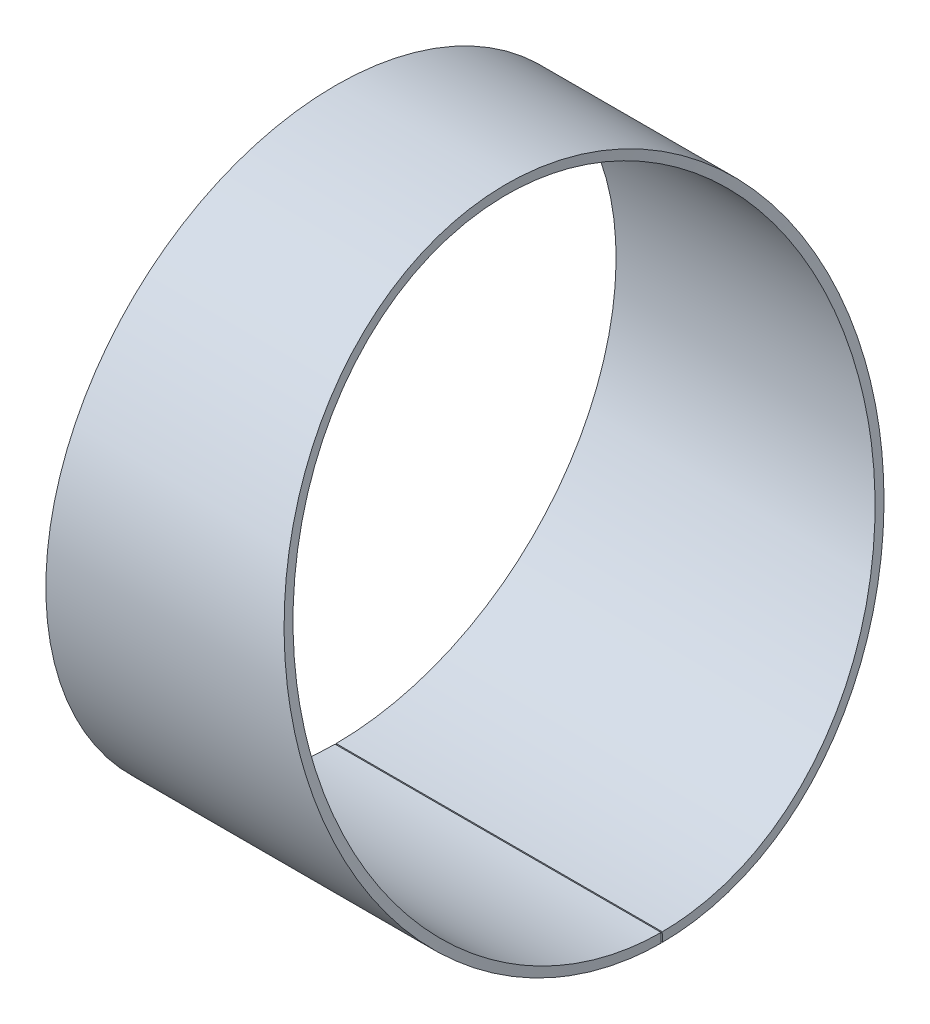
ISO-10303-21;
HEADER;
FILE_DESCRIPTION(('STEP AP214'),'2;1');
FILE_NAME('part.step','',(''),(''),'','','');
FILE_SCHEMA(('AUTOMOTIVE_DESIGN { 1 0 10303 214 1 1 1 1 }'));
ENDSEC;
DATA;
#1=APPLICATION_CONTEXT('core data for automotive mechanical design processes');
#2=APPLICATION_PROTOCOL_DEFINITION('international standard','automotive_design',2000,#1);
#3=PRODUCT_CONTEXT('',#1,'mechanical');
#4=PRODUCT('Part','Part','',(#3));
#5=PRODUCT_RELATED_PRODUCT_CATEGORY('part','',(#4));
#6=PRODUCT_DEFINITION_FORMATION('','',#4);
#7=PRODUCT_DEFINITION_CONTEXT('part definition',#1,'design');
#8=PRODUCT_DEFINITION('design','',#6,#7);
#9=PRODUCT_DEFINITION_SHAPE('','',#8);
#10=(LENGTH_UNIT() NAMED_UNIT(*) SI_UNIT(.MILLI.,.METRE.));
#11=(NAMED_UNIT(*) PLANE_ANGLE_UNIT() SI_UNIT($,.RADIAN.));
#12=(NAMED_UNIT(*) SI_UNIT($,.STERADIAN.) SOLID_ANGLE_UNIT());
#13=UNCERTAINTY_MEASURE_WITH_UNIT(LENGTH_MEASURE(1.E-05),#10,'distance_accuracy_value','');
#14=(GEOMETRIC_REPRESENTATION_CONTEXT(3) GLOBAL_UNCERTAINTY_ASSIGNED_CONTEXT((#13)) GLOBAL_UNIT_ASSIGNED_CONTEXT((#10,
#11,#12)) REPRESENTATION_CONTEXT('',''));
#15=CARTESIAN_POINT('',(0.,0.,0.));
#16=DIRECTION('',(0.,0.,1.));
#17=DIRECTION('',(1.,0.,0.));
#18=AXIS2_PLACEMENT_3D('',#15,#16,#17);
#19=CARTESIAN_POINT('',(-518.65348192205,-1049.9994999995,0.499999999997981));
#20=CARTESIAN_POINT('',(-518.654426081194,-1049.99806810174,1.21594744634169));
#21=CARTESIAN_POINT('',(-518.655502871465,-1049.99378476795,1.84336843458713));
#22=CARTESIAN_POINT('',(-518.657317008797,-1049.98608175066,2.65170481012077));
#23=CARTESIAN_POINT('',(-518.657954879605,-1049.98329226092,2.89901797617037));
#24=CARTESIAN_POINT('',(-518.659296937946,-1049.97766371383,3.34938188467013));
#25=CARTESIAN_POINT('',(-518.659990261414,-1049.97492479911,3.54586686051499));
#26=CARTESIAN_POINT('',(-518.663754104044,-1049.9607079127,4.49707700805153));
#27=CARTESIAN_POINT('',(-518.667921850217,-1049.94549859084,5.28238275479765));
#28=CARTESIAN_POINT('',(-518.678570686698,-1049.90603059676,6.90157262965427));
#29=CARTESIAN_POINT('',(-518.685042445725,-1049.88176091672,7.73195349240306));
#30=CARTESIAN_POINT('',(-518.700128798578,-1049.82542849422,9.37725020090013));
#31=CARTESIAN_POINT('',(-518.708764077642,-1049.79319370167,10.1999249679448));
#32=CARTESIAN_POINT('',(-518.757400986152,-1049.61166017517,14.3132291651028));
#33=CARTESIAN_POINT('',(-518.813773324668,-1049.40127730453,17.6031376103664));
#34=CARTESIAN_POINT('',(-519.035182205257,-1048.57495626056,27.4583579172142));
#35=CARTESIAN_POINT('',(-519.25257392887,-1047.76373260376,34.0126580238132));
#36=CARTESIAN_POINT('',(-519.827162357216,-1045.61920726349,47.0630760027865));
#37=CARTESIAN_POINT('',(-520.184109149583,-1044.28727743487,53.553429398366));
#38=CARTESIAN_POINT('',(-521.040014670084,-1041.09395050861,66.4676669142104));
#39=CARTESIAN_POINT('',(-521.538739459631,-1039.23291148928,72.8874692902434));
#40=CARTESIAN_POINT('',(-523.24722991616,-1032.8557968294,91.9676810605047));
#41=CARTESIAN_POINT('',(-524.667010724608,-1027.5578198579,104.431202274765));
#42=CARTESIAN_POINT('',(-527.239842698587,-1017.95631953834,122.646451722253));
#43=CARTESIAN_POINT('',(-528.170669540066,-1014.48176045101,128.631626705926));
#44=CARTESIAN_POINT('',(-530.178755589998,-1006.98648677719,140.374909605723));
#45=CARTESIAN_POINT('',(-531.255638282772,-1002.96819741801,146.131712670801));
#46=CARTESIAN_POINT('',(-533.569591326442,-994.333589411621,157.432597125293));
#47=CARTESIAN_POINT('',(-534.804959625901,-989.722998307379,162.966900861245));
#48=CARTESIAN_POINT('',(-536.775599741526,-982.367483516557,171.04197634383));
#49=CARTESIAN_POINT('',(-537.452077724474,-979.842432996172,173.695909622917));
#50=CARTESIAN_POINT('',(-538.844229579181,-974.646703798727,178.919251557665));
#51=CARTESIAN_POINT('',(-539.560096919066,-971.975503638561,181.489587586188));
#52=CARTESIAN_POINT('',(-541.778032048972,-963.699699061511,189.099406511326));
#53=CARTESIAN_POINT('',(-543.346613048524,-957.846387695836,194.023594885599));
#54=CARTESIAN_POINT('',(-545.834420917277,-948.56050431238,201.109263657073));
#55=CARTESIAN_POINT('',(-546.686179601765,-945.380991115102,203.420992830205));
#56=CARTESIAN_POINT('',(-548.434675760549,-938.854531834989,207.930642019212));
#57=CARTESIAN_POINT('',(-549.329321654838,-935.515589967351,210.123997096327));
#58=CARTESIAN_POINT('',(-552.108191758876,-925.146747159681,216.574626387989));
#59=CARTESIAN_POINT('',(-554.080833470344,-917.786506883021,220.685283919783));
#60=CARTESIAN_POINT('',(-557.219888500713,-906.069656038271,226.424693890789));
#61=CARTESIAN_POINT('',(-558.296255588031,-902.05150873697,228.266585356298));
#62=CARTESIAN_POINT('',(-559.955829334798,-895.857056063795,230.903574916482));
#63=CARTESIAN_POINT('',(-560.515332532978,-893.76892780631,231.759853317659));
#64=CARTESIAN_POINT('',(-561.656866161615,-889.508797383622,233.438250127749));
#65=CARTESIAN_POINT('',(-562.238731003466,-887.337352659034,234.259954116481));
#66=CARTESIAN_POINT('',(-564.017619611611,-880.698564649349,236.664105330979));
#67=CARTESIAN_POINT('',(-565.247937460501,-876.106625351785,238.185684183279));
#68=CARTESIAN_POINT('',(-567.797357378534,-866.592063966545,241.018952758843));
#69=CARTESIAN_POINT('',(-569.140844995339,-861.578615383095,242.358114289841));
#70=CARTESIAN_POINT('',(-571.263424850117,-853.656755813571,244.189061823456));
#71=CARTESIAN_POINT('',(-571.988612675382,-850.950110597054,244.769419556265));
#72=CARTESIAN_POINT('',(-573.102886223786,-846.791546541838,245.586129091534));
#73=CARTESIAN_POINT('',(-573.48171342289,-845.377835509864,245.851653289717));
#74=CARTESIAN_POINT('',(-574.261320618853,-842.468550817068,246.370869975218));
#75=CARTESIAN_POINT('',(-574.660994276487,-840.977089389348,246.623749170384));
#76=CARTESIAN_POINT('',(-575.889625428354,-836.392029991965,247.356427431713));
#77=CARTESIAN_POINT('',(-576.748193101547,-833.187688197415,247.810359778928));
#78=CARTESIAN_POINT('',(-578.095264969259,-828.159949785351,248.414706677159));
#79=CARTESIAN_POINT('',(-578.554158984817,-826.447182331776,248.603373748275));
#80=CARTESIAN_POINT('',(-579.140114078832,-824.260315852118,248.820477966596));
#81=CARTESIAN_POINT('',(-579.25641862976,-823.826243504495,248.862446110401));
#82=CARTESIAN_POINT('',(-579.49916794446,-822.920363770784,248.947512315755));
#83=CARTESIAN_POINT('',(-579.625671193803,-822.448334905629,248.990592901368));
#84=CARTESIAN_POINT('',(-580.020566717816,-820.974915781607,249.120503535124));
#85=CARTESIAN_POINT('',(-580.304344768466,-819.916190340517,249.208028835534));
#86=CARTESIAN_POINT('',(-581.825806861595,-814.239575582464,249.635684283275));
#87=CARTESIAN_POINT('',(-583.371206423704,-808.470524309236,249.95431050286));
#88=CARTESIAN_POINT('',(-585.479039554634,-800.603128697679,250.000800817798));
#89=CARTESIAN_POINT('',(-585.721744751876,-799.697360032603,250.001385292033));
#90=CARTESIAN_POINT('',(-586.196286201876,-797.926234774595,249.992967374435));
#91=CARTESIAN_POINT('',(-586.428527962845,-797.059372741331,249.984143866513));
#92=CARTESIAN_POINT('',(-587.110166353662,-794.515011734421,249.945579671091));
#93=CARTESIAN_POINT('',(-587.544476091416,-792.893747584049,249.903770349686));
#94=CARTESIAN_POINT('',(-588.787057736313,-788.255480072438,249.743146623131));
#95=CARTESIAN_POINT('',(-589.534982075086,-785.464099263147,249.589541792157));
#96=CARTESIAN_POINT('',(-590.869903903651,-780.482984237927,249.249509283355));
#97=CARTESIAN_POINT('',(-591.456901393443,-778.29318567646,249.063082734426));
#98=CARTESIAN_POINT('',(-592.09006897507,-775.930436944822,248.839067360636));
#99=CARTESIAN_POINT('',(-592.210580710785,-775.480672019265,248.79511330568));
#100=CARTESIAN_POINT('',(-592.452500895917,-774.577797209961,248.704478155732));
#101=CARTESIAN_POINT('',(-592.572812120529,-774.128773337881,248.658161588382));
#102=CARTESIAN_POINT('',(-592.931799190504,-772.788950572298,248.516328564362));
#103=CARTESIAN_POINT('',(-593.168528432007,-771.905400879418,248.417929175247));
#104=CARTESIAN_POINT('',(-594.339197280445,-767.536068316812,247.908204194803));
#105=CARTESIAN_POINT('',(-595.23420481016,-764.195631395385,247.44382186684));
#106=CARTESIAN_POINT('',(-596.941164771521,-757.825423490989,246.438030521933));
#107=CARTESIAN_POINT('',(-597.753117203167,-754.795631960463,245.896624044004));
#108=CARTESIAN_POINT('',(-599.293966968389,-749.045121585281,244.769656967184));
#109=CARTESIAN_POINT('',(-600.045076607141,-746.241719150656,244.16782276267));
#110=CARTESIAN_POINT('',(-602.242916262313,-738.038959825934,242.265026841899));
#111=CARTESIAN_POINT('',(-603.631282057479,-732.858043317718,240.869888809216));
#112=CARTESIAN_POINT('',(-606.265203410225,-723.028087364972,237.911055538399));
#113=CARTESIAN_POINT('',(-607.534777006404,-718.289649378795,236.319773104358));
#114=CARTESIAN_POINT('',(-609.368056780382,-711.447906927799,233.804257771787));
#115=CARTESIAN_POINT('',(-609.967303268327,-709.211604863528,232.944294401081));
#116=CARTESIAN_POINT('',(-611.142102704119,-704.827295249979,231.187658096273));
#117=CARTESIAN_POINT('',(-611.718770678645,-702.675000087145,230.289419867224));
#118=CARTESIAN_POINT('',(-614.567385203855,-692.042136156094,225.679108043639));
#119=CARTESIAN_POINT('',(-616.717640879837,-684.015387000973,221.636764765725));
#120=CARTESIAN_POINT('',(-619.750070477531,-672.700067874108,215.205828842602));
#121=CARTESIAN_POINT('',(-620.728721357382,-669.048805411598,213.000793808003));
#122=CARTESIAN_POINT('',(-622.621705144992,-661.985082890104,208.4932521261));
#123=CARTESIAN_POINT('',(-623.537258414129,-658.567687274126,206.18839304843));
#124=CARTESIAN_POINT('',(-626.219141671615,-648.556991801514,199.077937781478));
#125=CARTESIAN_POINT('',(-627.910471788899,-642.243938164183,194.100545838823));
#126=CARTESIAN_POINT('',(-630.302578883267,-633.317652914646,186.366559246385));
#127=CARTESIAN_POINT('',(-631.07579990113,-630.432647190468,183.74385357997));
#128=CARTESIAN_POINT('',(-632.57394590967,-624.842432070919,178.422860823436));
#129=CARTESIAN_POINT('',(-633.298798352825,-622.137255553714,175.725067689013));
#130=CARTESIAN_POINT('',(-635.413248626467,-614.245190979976,167.490214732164));
#131=CARTESIAN_POINT('',(-636.738631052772,-609.297896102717,161.8263968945));
#132=CARTESIAN_POINT('',(-639.220893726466,-600.034501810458,150.229406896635));
#133=CARTESIAN_POINT('',(-640.376626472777,-595.722571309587,144.302689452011));
#134=CARTESIAN_POINT('',(-642.524731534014,-587.705427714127,132.225370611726));
#135=CARTESIAN_POINT('',(-643.520040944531,-583.989867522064,126.057877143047));
#136=CARTESIAN_POINT('',(-645.35317352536,-577.148292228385,113.525689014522));
#137=CARTESIAN_POINT('',(-646.190996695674,-574.022260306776,107.161011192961));
#138=CARTESIAN_POINT('',(-647.709156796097,-568.35736743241,94.2926928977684));
#139=CARTESIAN_POINT('',(-648.39042995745,-565.814157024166,87.7807967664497));
#140=CARTESIAN_POINT('',(-649.602049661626,-561.291514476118,74.6105640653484));
#141=CARTESIAN_POINT('',(-650.131703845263,-559.314892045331,67.9584567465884));
#142=CARTESIAN_POINT('',(-651.038700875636,-555.930858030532,54.5703854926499));
#143=CARTESIAN_POINT('',(-651.415737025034,-554.524163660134,47.8405700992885));
#144=CARTESIAN_POINT('',(-652.321809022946,-551.141567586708,27.5300946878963));
#145=CARTESIAN_POINT('',(-652.625197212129,-550.010211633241,13.8400340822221));
#146=CARTESIAN_POINT('',(-652.630653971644,-549.989926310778,-13.4686259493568));
#147=CARTESIAN_POINT('',(-652.332717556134,-551.100835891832,-27.1590620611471));
#148=CARTESIAN_POINT('',(-651.434815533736,-554.452948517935,-47.4736521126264));
#149=CARTESIAN_POINT('',(-651.060528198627,-555.849420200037,-54.2047473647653));
#150=CARTESIAN_POINT('',(-650.159027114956,-559.212897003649,-67.5960892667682));
#151=CARTESIAN_POINT('',(-649.632111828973,-561.1792512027,-74.2503664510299));
#152=CARTESIAN_POINT('',(-648.425951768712,-565.681500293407,-87.4260125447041));
#153=CARTESIAN_POINT('',(-647.747367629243,-568.214761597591,-93.9414950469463));
#154=CARTESIAN_POINT('',(-646.234784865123,-573.858933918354,-106.815820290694));
#155=CARTESIAN_POINT('',(-645.399692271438,-576.974716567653,-113.184259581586));
#156=CARTESIAN_POINT('',(-643.571904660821,-583.796242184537,-125.725449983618));
#157=CARTESIAN_POINT('',(-642.579209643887,-587.502002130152,-131.898184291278));
#158=CARTESIAN_POINT('',(-640.436217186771,-595.500219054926,-143.987394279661));
#159=CARTESIAN_POINT('',(-639.283292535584,-599.801738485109,-149.919016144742));
#160=CARTESIAN_POINT('',(-636.806305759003,-609.045404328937,-161.528318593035));
#161=CARTESIAN_POINT('',(-635.483504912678,-613.983007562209,-167.198929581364));
#162=CARTESIAN_POINT('',(-633.372842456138,-621.860923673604,-175.444921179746));
#163=CARTESIAN_POINT('',(-632.649231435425,-624.561488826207,-178.14658796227));
#164=CARTESIAN_POINT('',(-631.153991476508,-630.14086494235,-183.4741187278));
#165=CARTESIAN_POINT('',(-630.382220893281,-633.02044391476,-186.100278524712));
#166=CARTESIAN_POINT('',(-627.994457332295,-641.930462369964,-193.845207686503));
#167=CARTESIAN_POINT('',(-626.306012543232,-648.232688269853,-198.830668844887));
#168=CARTESIAN_POINT('',(-623.628441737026,-658.227328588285,-205.954479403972));
#169=CARTESIAN_POINT('',(-622.714190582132,-661.639922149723,-208.264273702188));
#170=CARTESIAN_POINT('',(-620.82512585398,-668.68911848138,-212.779160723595));
#171=CARTESIAN_POINT('',(-619.848416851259,-672.333128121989,-214.988270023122));
#172=CARTESIAN_POINT('',(-616.82175992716,-683.626819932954,-221.432672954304));
#173=CARTESIAN_POINT('',(-614.675282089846,-691.639322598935,-225.485656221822));
#174=CARTESIAN_POINT('',(-611.262505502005,-704.378106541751,-231.036594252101));
#175=CARTESIAN_POINT('',(-610.095208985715,-708.73421466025,-232.796259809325));
#176=CARTESIAN_POINT('',(-607.656382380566,-717.83580907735,-236.162206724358));
#177=CARTESIAN_POINT('',(-606.389531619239,-722.564051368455,-237.760266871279));
#178=CARTESIAN_POINT('',(-604.418099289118,-729.92160836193,-239.990805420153));
#179=CARTESIAN_POINT('',(-603.745469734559,-732.431719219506,-240.710818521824));
#180=CARTESIAN_POINT('',(-602.359692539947,-737.603272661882,-242.102910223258));
#181=CARTESIAN_POINT('',(-601.648014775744,-740.259258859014,-242.77331803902));
#182=CARTESIAN_POINT('',(-600.187080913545,-745.711721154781,-244.050451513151));
#183=CARTESIAN_POINT('',(-599.437824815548,-748.508200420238,-244.657176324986));
#184=CARTESIAN_POINT('',(-597.901734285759,-754.241018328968,-245.793927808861));
#185=CARTESIAN_POINT('',(-597.097118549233,-757.243454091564,-246.337500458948));
#186=CARTESIAN_POINT('',(-595.399970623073,-763.576981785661,-247.353290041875));
#187=CARTESIAN_POINT('',(-594.509826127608,-766.899217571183,-247.823734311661));
#188=CARTESIAN_POINT('',(-593.112253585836,-772.115439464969,-248.44620656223));
#189=CARTESIAN_POINT('',(-592.63601054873,-773.892946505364,-248.639803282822));
#190=CARTESIAN_POINT('',(-591.662710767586,-777.525345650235,-248.994417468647));
#191=CARTESIAN_POINT('',(-591.0956210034,-779.640867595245,-249.181406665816));
#192=CARTESIAN_POINT('',(-589.800561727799,-784.473040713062,-249.529119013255));
#193=CARTESIAN_POINT('',(-589.072592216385,-787.189754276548,-249.689841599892));
#194=CARTESIAN_POINT('',(-587.859978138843,-791.716027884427,-249.867276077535));
#195=CARTESIAN_POINT('',(-587.435663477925,-793.299963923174,-249.915711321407));
#196=CARTESIAN_POINT('',(-586.769026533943,-795.788395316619,-249.965899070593));
#197=CARTESIAN_POINT('',(-586.541786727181,-796.63662472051,-249.978877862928));
#198=CARTESIAN_POINT('',(-586.077252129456,-798.370517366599,-249.996192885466));
#199=CARTESIAN_POINT('',(-585.837614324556,-799.264884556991,-250.000514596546));
#200=CARTESIAN_POINT('',(-583.683839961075,-807.303113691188,-249.995433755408));
#201=CARTESIAN_POINT('',(-582.09745503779,-813.225895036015,-249.694276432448));
#202=CARTESIAN_POINT('',(-580.52457535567,-819.094526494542,-249.272509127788));
#203=CARTESIAN_POINT('',(-580.230504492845,-820.191659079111,-249.185365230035));
#204=CARTESIAN_POINT('',(-579.820155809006,-821.72267826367,-249.054989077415));
#205=CARTESIAN_POINT('',(-579.688499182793,-822.213905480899,-249.011580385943));
#206=CARTESIAN_POINT('',(-579.435438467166,-823.158177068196,-248.925538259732));
#207=CARTESIAN_POINT('',(-579.315211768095,-823.606840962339,-248.883330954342));
#208=CARTESIAN_POINT('',(-578.725788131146,-825.806611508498,-248.6707555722));
#209=CARTESIAN_POINT('',(-578.264128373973,-827.529690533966,-248.485409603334));
#210=CARTESIAN_POINT('',(-576.908786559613,-832.588297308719,-247.890164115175));
#211=CARTESIAN_POINT('',(-576.044741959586,-835.813128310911,-247.441150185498));
#212=CARTESIAN_POINT('',(-574.395685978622,-841.967203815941,-246.472020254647));
#213=CARTESIAN_POINT('',(-573.610781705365,-844.896067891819,-245.95198381));
#214=CARTESIAN_POINT('',(-572.119577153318,-850.461314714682,-244.870763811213));
#215=CARTESIAN_POINT('',(-571.39165540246,-853.178165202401,-244.293835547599));
#216=CARTESIAN_POINT('',(-569.260931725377,-861.130449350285,-242.471956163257));
#217=CARTESIAN_POINT('',(-567.911171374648,-866.16734808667,-241.136191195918));
#218=CARTESIAN_POINT('',(-565.353094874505,-875.714134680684,-238.311037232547));
#219=CARTESIAN_POINT('',(-564.11960473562,-880.31794362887,-236.793786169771));
#220=CARTESIAN_POINT('',(-562.335220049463,-886.97726486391,-234.393947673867));
#221=CARTESIAN_POINT('',(-561.7515368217,-889.155500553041,-233.573468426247));
#222=CARTESIAN_POINT('',(-560.606393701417,-893.429091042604,-231.897118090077));
#223=CARTESIAN_POINT('',(-560.04542666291,-895.522647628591,-231.042158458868));
#224=CARTESIAN_POINT('',(-558.381684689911,-901.732602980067,-228.409059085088));
#225=CARTESIAN_POINT('',(-557.302599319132,-905.760904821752,-226.569231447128));
#226=CARTESIAN_POINT('',(-554.155571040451,-917.507580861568,-220.834578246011));
#227=CARTESIAN_POINT('',(-552.17785596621,-924.886847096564,-216.72518026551));
#228=CARTESIAN_POINT('',(-549.391739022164,-935.282678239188,-210.274175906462));
#229=CARTESIAN_POINT('',(-548.494930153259,-938.629638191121,-208.080762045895));
#230=CARTESIAN_POINT('',(-546.74252355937,-945.170656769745,-203.571266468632));
#231=CARTESIAN_POINT('',(-545.888866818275,-948.357250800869,-201.259360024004));
#232=CARTESIAN_POINT('',(-543.395536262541,-957.663755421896,-194.172489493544));
#233=CARTESIAN_POINT('',(-541.823502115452,-963.529983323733,-189.246607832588));
#234=CARTESIAN_POINT('',(-539.600730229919,-971.823867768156,-181.633262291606));
#235=CARTESIAN_POINT('',(-538.883296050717,-974.500925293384,-179.061524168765));
#236=CARTESIAN_POINT('',(-537.488355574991,-979.707065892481,-173.836051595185));
#237=CARTESIAN_POINT('',(-536.810536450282,-982.237115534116,-171.180958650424));
#238=CARTESIAN_POINT('',(-534.836032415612,-989.607020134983,-163.102193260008));
#239=CARTESIAN_POINT('',(-533.598300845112,-994.226392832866,-157.565149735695));
#240=CARTESIAN_POINT('',(-531.280046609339,-1002.87704645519,-146.258579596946));
#241=CARTESIAN_POINT('',(-530.201265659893,-1006.90249892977,-140.498956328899));
#242=CARTESIAN_POINT('',(-528.189736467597,-1014.41070605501,-128.750339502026));
#243=CARTESIAN_POINT('',(-527.257304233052,-1017.89125989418,-122.762291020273));
#244=CARTESIAN_POINT('',(-524.680004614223,-1027.50938457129,-104.538054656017));
#245=CARTESIAN_POINT('',(-523.257765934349,-1032.81645173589,-92.0685389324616));
#246=CARTESIAN_POINT('',(-521.546112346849,-1039.20538754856,-72.978158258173));
#247=CARTESIAN_POINT('',(-521.046419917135,-1041.07005009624,-66.5547453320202));
#248=CARTESIAN_POINT('',(-520.188752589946,-1044.26995722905,-53.6329299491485));
#249=CARTESIAN_POINT('',(-519.831015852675,-1045.60482243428,-47.1387320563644));
#250=CARTESIAN_POINT('',(-519.255020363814,-1047.75461890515,-34.0798719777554));
#251=CARTESIAN_POINT('',(-519.037009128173,-1048.56812073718,-27.5216274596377));
#252=CARTESIAN_POINT('',(-518.814794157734,-1049.39747486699,-17.6574965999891));
#253=CARTESIAN_POINT('',(-518.758148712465,-1049.60890668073,-14.3612882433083));
#254=CARTESIAN_POINT('',(-518.70926939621,-1049.79125264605,-10.2473609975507));
#255=CARTESIAN_POINT('',(-518.700592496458,-1049.82362337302,-9.42513066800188));
#256=CARTESIAN_POINT('',(-518.689225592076,-1049.86606207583,-8.19267926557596));
#257=CARTESIAN_POINT('',(-518.685711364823,-1049.87918875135,-7.7820111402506));
#258=CARTESIAN_POINT('',(-518.679232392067,-1049.9034081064,-6.9609830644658));
#259=CARTESIAN_POINT('',(-518.676271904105,-1049.91443970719,-6.55370347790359));
#260=CARTESIAN_POINT('',(-518.662740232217,-1049.96620851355,-4.44363098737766));
#261=CARTESIAN_POINT('',(-518.656045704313,-1049.99536735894,-2.56631614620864));
#262=CARTESIAN_POINT('',(-518.65348192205,-1049.9994999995,-0.500000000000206));
#263=CARTESIAN_POINT('',(-518.65348192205,-1041.99951599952,0.483999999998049));
#264=CARTESIAN_POINT('',(-518.654426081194,-1041.99812992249,1.17703712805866));
#265=CARTESIAN_POINT('',(-518.655502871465,-1041.99398365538,1.78438064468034));
#266=CARTESIAN_POINT('',(-518.657317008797,-1041.98652713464,2.56685025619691));
#267=CARTESIAN_POINT('',(-518.657954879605,-1041.98382690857,2.80624940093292));
#268=CARTESIAN_POINT('',(-518.659296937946,-1041.97837847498,3.24220166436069));
#269=CARTESIAN_POINT('',(-518.659990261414,-1041.97572720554,3.43239912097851));
#270=CARTESIAN_POINT('',(-518.663754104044,-1041.96196525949,4.35317054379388));
#271=CARTESIAN_POINT('',(-518.667921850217,-1041.94724263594,5.11334650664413));
#272=CARTESIAN_POINT('',(-518.678570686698,-1041.90903761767,6.68072230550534));
#273=CARTESIAN_POINT('',(-518.685042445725,-1041.88554456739,7.48453098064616));
#274=CARTESIAN_POINT('',(-518.700128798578,-1041.8310147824,9.07717819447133));
#275=CARTESIAN_POINT('',(-518.708764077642,-1041.79981150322,9.87352736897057));
#276=CARTESIAN_POINT('',(-518.757400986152,-1041.62408704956,13.8552058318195));
#277=CARTESIAN_POINT('',(-518.813773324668,-1041.42043643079,17.0398372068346));
#278=CARTESIAN_POINT('',(-519.035182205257,-1040.62055766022,26.5796904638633));
#279=CARTESIAN_POINT('',(-519.25257392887,-1039.83529316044,32.9242529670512));
#280=CARTESIAN_POINT('',(-519.827162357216,-1037.75939263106,45.5570575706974));
#281=CARTESIAN_POINT('',(-520.184109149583,-1036.47008455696,51.8397196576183));
#282=CARTESIAN_POINT('',(-521.040014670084,-1033.37894409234,64.3407015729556));
#283=CARTESIAN_POINT('',(-521.538739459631,-1031.57745832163,70.5550702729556));
#284=CARTESIAN_POINT('',(-523.24722991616,-1025.40441133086,89.0247152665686));
#285=CARTESIAN_POINT('',(-524.667010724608,-1020.27596962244,101.089403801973));
#286=CARTESIAN_POINT('',(-527.239842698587,-1010.98171731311,118.72176526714));
#287=CARTESIAN_POINT('',(-528.170669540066,-1007.61834411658,124.515414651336));
#288=CARTESIAN_POINT('',(-530.178755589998,-1000.36291920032,135.88291249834));
#289=CARTESIAN_POINT('',(-531.255638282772,-996.473215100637,141.455497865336));
#290=CARTESIAN_POINT('',(-533.569591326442,-988.114914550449,152.394754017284));
#291=CARTESIAN_POINT('',(-534.804959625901,-983.651862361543,157.751960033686));
#292=CARTESIAN_POINT('',(-536.775599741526,-976.531724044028,165.568633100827));
#293=CARTESIAN_POINT('',(-537.452077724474,-974.087475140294,168.137640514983));
#294=CARTESIAN_POINT('',(-538.844229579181,-969.058009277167,173.193835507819));
#295=CARTESIAN_POINT('',(-539.560096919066,-966.472287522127,175.68192078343));
#296=CARTESIAN_POINT('',(-541.778032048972,-958.461308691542,183.048225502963));
#297=CARTESIAN_POINT('',(-543.346613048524,-952.79530328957,187.81483984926));
#298=CARTESIAN_POINT('',(-545.834420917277,-943.806568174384,194.673767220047));
#299=CARTESIAN_POINT('',(-546.686179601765,-940.728799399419,196.911521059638));
#300=CARTESIAN_POINT('',(-548.434675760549,-934.411186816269,201.276861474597));
#301=CARTESIAN_POINT('',(-549.329321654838,-931.179091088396,203.400029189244));
#302=CARTESIAN_POINT('',(-552.108191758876,-921.142051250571,209.644238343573));
#303=CARTESIAN_POINT('',(-554.080833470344,-914.017338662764,213.62335483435));
#304=CARTESIAN_POINT('',(-557.219888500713,-902.675427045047,219.179103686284));
#305=CARTESIAN_POINT('',(-558.296255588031,-898.785860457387,220.962054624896));
#306=CARTESIAN_POINT('',(-559.955829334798,-892.789630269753,223.514660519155));
#307=CARTESIAN_POINT('',(-560.515332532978,-890.768322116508,224.343538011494));
#308=CARTESIAN_POINT('',(-561.656866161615,-886.644515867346,225.968226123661));
#309=CARTESIAN_POINT('',(-562.238731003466,-884.542557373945,226.763635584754));
#310=CARTESIAN_POINT('',(-564.017619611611,-878.11621058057,229.090853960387));
#311=CARTESIAN_POINT('',(-565.247937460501,-873.671213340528,230.563742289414));
#312=CARTESIAN_POINT('',(-567.797357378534,-864.461117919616,233.30634627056));
#313=CARTESIAN_POINT('',(-569.140844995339,-859.608099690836,234.602654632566));
#314=CARTESIAN_POINT('',(-571.263424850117,-851.939739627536,236.375011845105));
#315=CARTESIAN_POINT('',(-571.988612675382,-849.319707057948,236.936798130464));
#316=CARTESIAN_POINT('',(-573.102886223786,-845.294217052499,237.727372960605));
#317=CARTESIAN_POINT('',(-573.48171342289,-843.925744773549,237.984400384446));
#318=CARTESIAN_POINT('',(-574.261320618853,-841.109557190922,238.487002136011));
#319=CARTESIAN_POINT('',(-574.660994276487,-839.665822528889,238.731789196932));
#320=CARTESIAN_POINT('',(-575.889625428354,-835.227485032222,239.441021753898));
#321=CARTESIAN_POINT('',(-576.748193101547,-832.125682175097,239.880428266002));
#322=CARTESIAN_POINT('',(-578.095264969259,-827.25883139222,240.46543606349));
#323=CARTESIAN_POINT('',(-578.554158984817,-825.600872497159,240.64806578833));
#324=CARTESIAN_POINT('',(-579.140114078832,-823.483985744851,240.858222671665));
#325=CARTESIAN_POINT('',(-579.25641862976,-823.063803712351,240.898847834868));
#326=CARTESIAN_POINT('',(-579.49916794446,-822.186912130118,240.981191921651));
#327=CARTESIAN_POINT('',(-579.625671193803,-821.729988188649,241.022893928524));
#328=CARTESIAN_POINT('',(-580.020566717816,-820.303718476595,241.148647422));
#329=CARTESIAN_POINT('',(-580.304344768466,-819.27887224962,241.233371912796));
#330=CARTESIAN_POINT('',(-581.825806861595,-813.783909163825,241.64734238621));
#331=CARTESIAN_POINT('',(-583.371206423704,-808.199467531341,241.955772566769));
#332=CARTESIAN_POINT('',(-585.479039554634,-800.583828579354,242.000775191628));
#333=CARTESIAN_POINT('',(-585.721744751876,-799.70704451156,242.001340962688));
#334=CARTESIAN_POINT('',(-586.196286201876,-797.992595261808,241.993192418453));
#335=CARTESIAN_POINT('',(-586.428527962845,-797.153472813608,241.984651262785));
#336=CARTESIAN_POINT('',(-587.110166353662,-794.69053135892,241.947321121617));
#337=CARTESIAN_POINT('',(-587.544476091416,-793.12114766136,241.906849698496));
#338=CARTESIAN_POINT('',(-588.787057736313,-788.63130471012,241.751365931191));
#339=CARTESIAN_POINT('',(-589.534982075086,-785.929248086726,241.602676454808));
#340=CARTESIAN_POINT('',(-590.869903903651,-781.107528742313,241.273524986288));
#341=CARTESIAN_POINT('',(-591.456901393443,-778.987803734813,241.093064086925));
#342=CARTESIAN_POINT('',(-592.09006897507,-776.700662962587,240.876217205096));
#343=CARTESIAN_POINT('',(-592.210580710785,-776.265290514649,240.833669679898));
#344=CARTESIAN_POINT('',(-592.452500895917,-775.391307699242,240.745934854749));
#345=CARTESIAN_POINT('',(-592.572812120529,-774.956652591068,240.701100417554));
#346=CARTESIAN_POINT('',(-592.931799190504,-773.659704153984,240.563806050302));
#347=CARTESIAN_POINT('',(-593.168528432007,-772.804428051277,240.468555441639));
#348=CARTESIAN_POINT('',(-594.339197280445,-768.574914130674,239.97514166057));
#349=CARTESIAN_POINT('',(-595.23420481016,-765.341371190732,239.525619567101));
#350=CARTESIAN_POINT('',(-596.941164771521,-759.175009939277,238.552013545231));
#351=CARTESIAN_POINT('',(-597.753117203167,-756.242171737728,238.027932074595));
#352=CARTESIAN_POINT('',(-599.293966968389,-750.675677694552,236.937027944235));
#353=CARTESIAN_POINT('',(-600.045076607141,-747.961984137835,236.354452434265));
#354=CARTESIAN_POINT('',(-602.242916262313,-740.021713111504,234.512545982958));
#355=CARTESIAN_POINT('',(-603.631282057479,-735.006585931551,233.162052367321));
#356=CARTESIAN_POINT('',(-606.265203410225,-725.491188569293,230.29790176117));
#357=CARTESIAN_POINT('',(-607.534777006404,-720.904380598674,228.757540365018));
#358=CARTESIAN_POINT('',(-609.368056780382,-714.281573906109,226.32252152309));
#359=CARTESIAN_POINT('',(-609.967303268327,-712.116833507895,225.490076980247));
#360=CARTESIAN_POINT('',(-611.142102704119,-707.872821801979,223.789653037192));
#361=CARTESIAN_POINT('',(-611.718770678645,-705.789400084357,222.920158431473));
#362=CARTESIAN_POINT('',(-614.567385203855,-695.496787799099,218.457376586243));
#363=CARTESIAN_POINT('',(-616.717640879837,-687.726894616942,214.544388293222));
#364=CARTESIAN_POINT('',(-619.750070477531,-676.773665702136,208.319242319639));
#365=CARTESIAN_POINT('',(-620.728721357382,-673.239243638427,206.184768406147));
#366=CARTESIAN_POINT('',(-622.621705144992,-666.401560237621,201.821468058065));
#367=CARTESIAN_POINT('',(-623.537258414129,-663.093521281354,199.590364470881));
#368=CARTESIAN_POINT('',(-626.219141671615,-653.403168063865,192.707443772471));
#369=CARTESIAN_POINT('',(-627.910471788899,-647.29213214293,187.88932837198));
#370=CARTESIAN_POINT('',(-630.302578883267,-638.651488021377,180.402829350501));
#371=CARTESIAN_POINT('',(-631.07579990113,-635.858802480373,177.864050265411));
#372=CARTESIAN_POINT('',(-632.57394590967,-630.44747424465,172.713329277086));
#373=CARTESIAN_POINT('',(-633.298798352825,-627.828863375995,170.101865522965));
#374=CARTESIAN_POINT('',(-635.413248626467,-620.189344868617,162.130527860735));
#375=CARTESIAN_POINT('',(-636.738631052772,-615.40036342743,156.647952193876));
#376=CARTESIAN_POINT('',(-639.220893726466,-606.433397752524,145.422065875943));
#377=CARTESIAN_POINT('',(-640.376626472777,-602.25944902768,139.685003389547));
#378=CARTESIAN_POINT('',(-642.524731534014,-594.498854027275,127.994158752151));
#379=CARTESIAN_POINT('',(-643.520040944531,-590.902191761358,122.02402507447));
#380=CARTESIAN_POINT('',(-645.35317352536,-584.279546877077,109.892866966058));
#381=CARTESIAN_POINT('',(-646.190996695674,-581.253547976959,103.731858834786));
#382=CARTESIAN_POINT('',(-647.709156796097,-575.769931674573,91.2753267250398));
#383=CARTESIAN_POINT('',(-648.39042995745,-573.308103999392,84.9718112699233));
#384=CARTESIAN_POINT('',(-649.602049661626,-568.930186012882,72.2230260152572));
#385=CARTESIAN_POINT('',(-650.131703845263,-567.01681549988,65.7837861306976));
#386=CARTESIAN_POINT('',(-651.038700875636,-563.741070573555,52.8241331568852));
#387=CARTESIAN_POINT('',(-651.415737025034,-562.37939042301,46.3096718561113));
#388=CARTESIAN_POINT('',(-652.321809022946,-559.105037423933,26.6491316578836));
#389=CARTESIAN_POINT('',(-652.625197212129,-558.009884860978,13.397152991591));
#390=CARTESIAN_POINT('',(-652.630653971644,-557.990248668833,-13.0376299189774));
#391=CARTESIAN_POINT('',(-652.332717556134,-559.065609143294,-26.2899720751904));
#392=CARTESIAN_POINT('',(-651.434815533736,-562.310454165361,-45.9544952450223));
#393=CARTESIAN_POINT('',(-651.060528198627,-563.662238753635,-52.4701954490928));
#394=CARTESIAN_POINT('',(-650.159027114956,-566.918084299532,-65.4330144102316));
#395=CARTESIAN_POINT('',(-649.632111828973,-568.821515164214,-71.874354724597));
#396=CARTESIAN_POINT('',(-648.425951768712,-573.179692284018,-84.6283801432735));
#397=CARTESIAN_POINT('',(-647.747367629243,-575.631889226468,-90.935367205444));
#398=CARTESIAN_POINT('',(-646.234784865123,-581.095448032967,-103.397714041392));
#399=CARTESIAN_POINT('',(-645.399692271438,-584.111525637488,-109.562363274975));
#400=CARTESIAN_POINT('',(-643.571904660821,-590.714762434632,-121.702235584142));
#401=CARTESIAN_POINT('',(-642.579209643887,-594.301938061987,-127.677442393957));
#402=CARTESIAN_POINT('',(-640.436217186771,-602.044212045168,-139.379797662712));
#403=CARTESIAN_POINT('',(-639.283292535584,-606.208082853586,-145.121607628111));
#404=CARTESIAN_POINT('',(-636.806305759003,-615.155951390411,-156.359412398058));
#405=CARTESIAN_POINT('',(-635.483504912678,-619.935551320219,-161.848563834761));
#406=CARTESIAN_POINT('',(-633.372842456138,-627.561374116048,-169.830683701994));
#407=CARTESIAN_POINT('',(-632.649231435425,-630.175521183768,-172.445897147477));
#408=CARTESIAN_POINT('',(-631.153991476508,-635.576357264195,-177.602946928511));
#409=CARTESIAN_POINT('',(-630.382220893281,-638.363789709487,-180.145069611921));
#410=CARTESIAN_POINT('',(-627.994457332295,-646.988687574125,-187.642161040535));
#411=CARTESIAN_POINT('',(-626.306012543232,-653.089242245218,-192.468087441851));
#412=CARTESIAN_POINT('',(-623.628441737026,-662.76405407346,-199.363936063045));
#413=CARTESIAN_POINT('',(-622.714190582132,-666.067444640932,-201.599816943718));
#414=CARTESIAN_POINT('',(-620.82512585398,-672.891066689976,-205.97022758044));
#415=CARTESIAN_POINT('',(-619.848416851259,-676.418468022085,-208.108645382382));
#416=CARTESIAN_POINT('',(-616.82175992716,-687.350761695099,-214.346827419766));
#417=CARTESIAN_POINT('',(-614.675282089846,-695.106864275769,-218.270115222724));
#418=CARTESIAN_POINT('',(-611.262505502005,-707.438007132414,-223.643423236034));
#419=CARTESIAN_POINT('',(-610.095208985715,-711.654719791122,-225.346779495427));
#420=CARTESIAN_POINT('',(-607.656382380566,-720.465063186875,-228.605016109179));
#421=CARTESIAN_POINT('',(-606.389531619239,-725.042001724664,-230.151938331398));
#422=CARTESIAN_POINT('',(-604.418099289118,-732.164116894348,-232.311099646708));
#423=CARTESIAN_POINT('',(-603.745469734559,-734.593904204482,-233.008072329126));
#424=CARTESIAN_POINT('',(-602.359692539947,-739.599967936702,-234.355617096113));
#425=CARTESIAN_POINT('',(-601.648014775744,-742.170962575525,-235.004571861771));
#426=CARTESIAN_POINT('',(-600.187080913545,-747.448946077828,-236.240837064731));
#427=CARTESIAN_POINT('',(-599.437824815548,-750.15593800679,-236.828146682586));
#428=CARTESIAN_POINT('',(-597.901734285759,-755.705305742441,-237.928522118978));
#429=CARTESIAN_POINT('',(-597.097118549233,-758.611663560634,-238.454700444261));
#430=CARTESIAN_POINT('',(-595.399970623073,-764.74251836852,-239.437984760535));
#431=CARTESIAN_POINT('',(-594.509826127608,-767.958442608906,-239.893374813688));
#432=CARTESIAN_POINT('',(-593.112253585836,-773.00774540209,-240.495927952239));
#433=CARTESIAN_POINT('',(-592.63601054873,-774.728372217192,-240.683329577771));
#434=CARTESIAN_POINT('',(-591.662710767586,-778.244534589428,-241.02659610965));
#435=CARTESIAN_POINT('',(-591.0956210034,-780.292359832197,-241.20760165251));
#436=CARTESIAN_POINT('',(-589.800561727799,-784.969903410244,-241.544187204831));
#437=CARTESIAN_POINT('',(-589.072592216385,-787.599682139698,-241.699766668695));
#438=CARTESIAN_POINT('',(-587.859978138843,-791.981114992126,-241.871523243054));
#439=CARTESIAN_POINT('',(-587.435663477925,-793.514365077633,-241.918408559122));
#440=CARTESIAN_POINT('',(-586.769026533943,-795.923166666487,-241.966990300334));
#441=CARTESIAN_POINT('',(-586.541786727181,-796.744252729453,-241.979553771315));
#442=CARTESIAN_POINT('',(-586.077252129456,-798.422660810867,-241.996314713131));
#443=CARTESIAN_POINT('',(-585.837614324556,-799.288408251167,-242.000498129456));
#444=CARTESIAN_POINT('',(-583.683839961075,-807.06941405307,-241.995579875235));
#445=CARTESIAN_POINT('',(-582.09745503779,-812.802666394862,-241.704059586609));
#446=CARTESIAN_POINT('',(-580.52457535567,-818.483501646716,-241.295788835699));
#447=CARTESIAN_POINT('',(-580.230504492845,-819.545525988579,-241.211433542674));
#448=CARTESIAN_POINT('',(-579.820155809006,-821.027552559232,-241.085229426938));
#449=CARTESIAN_POINT('',(-579.688499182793,-821.50306050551,-241.043209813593));
#450=CARTESIAN_POINT('',(-579.435438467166,-822.417115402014,-240.959921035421));
#451=CARTESIAN_POINT('',(-579.315211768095,-822.851422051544,-240.919064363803));
#452=CARTESIAN_POINT('',(-578.725788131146,-824.980799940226,-240.713291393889));
#453=CARTESIAN_POINT('',(-578.264128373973,-826.648740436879,-240.533876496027));
#454=CARTESIAN_POINT('',(-576.908786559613,-831.54547179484,-239.95767886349));
#455=CARTESIAN_POINT('',(-576.044741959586,-834.667108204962,-239.523033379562));
#456=CARTESIAN_POINT('',(-574.395685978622,-840.624253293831,-238.584915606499));
#457=CARTESIAN_POINT('',(-573.610781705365,-843.459393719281,-238.08152032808));
#458=CARTESIAN_POINT('',(-572.119577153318,-848.846552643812,-237.034899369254));
#459=CARTESIAN_POINT('',(-571.39165540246,-851.476463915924,-236.476432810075));
#460=CARTESIAN_POINT('',(-569.260931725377,-859.174274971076,-234.712853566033));
#461=CARTESIAN_POINT('',(-567.911171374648,-864.049992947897,-233.419833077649));
#462=CARTESIAN_POINT('',(-565.353094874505,-873.291282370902,-230.685084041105));
#463=CARTESIAN_POINT('',(-564.11960473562,-877.747769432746,-229.216385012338));
#464=CARTESIAN_POINT('',(-562.335220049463,-884.193992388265,-226.893341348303));
#465=CARTESIAN_POINT('',(-561.7515368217,-886.302524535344,-226.099117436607));
#466=CARTESIAN_POINT('',(-560.606393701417,-890.439360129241,-224.476410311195));
#467=CARTESIAN_POINT('',(-560.04542666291,-892.465922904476,-223.648809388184));
#468=CARTESIAN_POINT('',(-558.381684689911,-898.477159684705,-221.099969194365));
#469=CARTESIAN_POINT('',(-557.302599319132,-902.376555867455,-219.31901604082));
#470=CARTESIAN_POINT('',(-554.155571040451,-913.747338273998,-213.767871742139));
#471=CARTESIAN_POINT('',(-552.17785596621,-920.890467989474,-209.789974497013));
#472=CARTESIAN_POINT('',(-549.391739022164,-930.953632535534,-203.545402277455));
#473=CARTESIAN_POINT('',(-548.494930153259,-934.193489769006,-201.422177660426));
#474=CARTESIAN_POINT('',(-546.74252355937,-940.525195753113,-197.056985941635));
#475=CARTESIAN_POINT('',(-545.888866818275,-943.609818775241,-194.819060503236));
#476=CARTESIAN_POINT('',(-543.395536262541,-952.618515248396,-187.958969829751));
#477=CARTESIAN_POINT('',(-541.823502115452,-958.297023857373,-183.190716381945));
#478=CARTESIAN_POINT('',(-539.600730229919,-966.325503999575,-175.820997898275));
#479=CARTESIAN_POINT('',(-538.883296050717,-968.916895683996,-173.331555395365));
#480=CARTESIAN_POINT('',(-537.488355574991,-973.956439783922,-168.273297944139));
#481=CARTESIAN_POINT('',(-536.810536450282,-976.405527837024,-165.703167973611));
#482=CARTESIAN_POINT('',(-534.836032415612,-983.539595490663,-157.882923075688));
#483=CARTESIAN_POINT('',(-533.598300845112,-988.011148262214,-152.523064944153));
#484=CARTESIAN_POINT('',(-531.280046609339,-996.384980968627,-141.578305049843));
#485=CARTESIAN_POINT('',(-530.201265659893,-1000.28161896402,-136.002989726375));
#486=CARTESIAN_POINT('',(-528.189736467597,-1007.54956346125,-124.630328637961));
#487=CARTESIAN_POINT('',(-527.257304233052,-1010.91873957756,-118.833897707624));
#488=CARTESIAN_POINT('',(-524.680004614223,-1020.22908426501,-101.192836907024));
#489=CARTESIAN_POINT('',(-523.257765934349,-1025.36632528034,-89.1223456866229));
#490=CARTESIAN_POINT('',(-521.546112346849,-1031.55081514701,-70.6428571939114));
#491=CARTESIAN_POINT('',(-521.046419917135,-1033.35580849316,-64.4249934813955));
#492=CARTESIAN_POINT('',(-520.188752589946,-1036.45331859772,-51.9166761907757));
#493=CARTESIAN_POINT('',(-519.831015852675,-1037.74546811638,-45.6302926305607));
#494=CARTESIAN_POINT('',(-519.255020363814,-1039.82647110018,-32.9893160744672));
#495=CARTESIAN_POINT('',(-519.037009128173,-1040.61394087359,-26.6409353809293));
#496=CARTESIAN_POINT('',(-518.814794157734,-1041.41675567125,-17.0924567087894));
#497=CARTESIAN_POINT('',(-518.758148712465,-1041.62142166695,-13.9017270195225));
#498=CARTESIAN_POINT('',(-518.70926939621,-1041.79793256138,-9.91944544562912));
#499=CARTESIAN_POINT('',(-518.700592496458,-1041.82926742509,-9.12352648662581));
#500=CARTESIAN_POINT('',(-518.689225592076,-1041.87034808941,-7.93051352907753));
#501=CARTESIAN_POINT('',(-518.685711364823,-1041.88305471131,-7.53298678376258));
#502=CARTESIAN_POINT('',(-518.679232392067,-1041.906499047,-6.73823160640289));
#503=CARTESIAN_POINT('',(-518.676271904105,-1041.91717763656,-6.34398496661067));
#504=CARTESIAN_POINT('',(-518.662740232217,-1041.96728984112,-4.30143479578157));
#505=CARTESIAN_POINT('',(-518.656045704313,-1041.99551560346,-2.48419402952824));
#506=CARTESIAN_POINT('',(-518.65348192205,-1041.99951599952,-0.484000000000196));
#507=B_SPLINE_SURFACE_WITH_KNOTS('',1,3,((#19,#20,#21,#22,#23,#24,#25,#26,#27,#28,#29,#30,#31,
#32,#33,#34,#35,#36,#37,#38,#39,#40,#41,#42,#43,#44,#45,#46,#47,#48,#49,#50,#51,#52,#53,#54,#55,
#56,#57,#58,#59,#60,#61,#62,#63,#64,#65,#66,#67,#68,#69,#70,#71,#72,#73,#74,#75,#76,#77,#78,#79,
#80,#81,#82,#83,#84,#85,#86,#87,#88,#89,#90,#91,#92,#93,#94,#95,#96,#97,#98,#99,#100,#101,#102,
#103,#104,#105,#106,#107,#108,#109,#110,#111,#112,#113,#114,#115,#116,#117,#118,#119,#120,#121,
#122,#123,#124,#125,#126,#127,#128,#129,#130,#131,#132,#133,#134,#135,#136,#137,#138,#139,#140,
#141,#142,#143,#144,#145,#146,#147,#148,#149,#150,#151,#152,#153,#154,#155,#156,#157,#158,#159,
#160,#161,#162,#163,#164,#165,#166,#167,#168,#169,#170,#171,#172,#173,#174,#175,#176,#177,#178,
#179,#180,#181,#182,#183,#184,#185,#186,#187,#188,#189,#190,#191,#192,#193,#194,#195,#196,#197,
#198,#199,#200,#201,#202,#203,#204,#205,#206,#207,#208,#209,#210,#211,#212,#213,#214,#215,#216,
#217,#218,#219,#220,#221,#222,#223,#224,#225,#226,#227,#228,#229,#230,#231,#232,#233,#234,#235,
#236,#237,#238,#239,#240,#241,#242,#243,#244,#245,#246,#247,#248,#249,#250,#251,#252,#253,#254,
#255,#256,#257,#258,#259,#260,#261,#262),(#263,#264,#265,#266,#267,#268,#269,#270,#271,#272,
#273,#274,#275,#276,#277,#278,#279,#280,#281,#282,#283,#284,#285,#286,#287,#288,#289,#290,#291,
#292,#293,#294,#295,#296,#297,#298,#299,#300,#301,#302,#303,#304,#305,#306,#307,#308,#309,#310,
#311,#312,#313,#314,#315,#316,#317,#318,#319,#320,#321,#322,#323,#324,#325,#326,#327,#328,#329,
#330,#331,#332,#333,#334,#335,#336,#337,#338,#339,#340,#341,#342,#343,#344,#345,#346,#347,#348,
#349,#350,#351,#352,#353,#354,#355,#356,#357,#358,#359,#360,#361,#362,#363,#364,#365,#366,#367,
#368,#369,#370,#371,#372,#373,#374,#375,#376,#377,#378,#379,#380,#381,#382,#383,#384,#385,#386,
#387,#388,#389,#390,#391,#392,#393,#394,#395,#396,#397,#398,#399,#400,#401,#402,#403,#404,#405,
#406,#407,#408,#409,#410,#411,#412,#413,#414,#415,#416,#417,#418,#419,#420,#421,#422,#423,#424,
#425,#426,#427,#428,#429,#430,#431,#432,#433,#434,#435,#436,#437,#438,#439,#440,#441,#442,#443,
#444,#445,#446,#447,#448,#449,#450,#451,#452,#453,#454,#455,#456,#457,#458,#459,#460,#461,#462,
#463,#464,#465,#466,#467,#468,#469,#470,#471,#472,#473,#474,#475,#476,#477,#478,#479,#480,#481,
#482,#483,#484,#485,#486,#487,#488,#489,#490,#491,#492,#493,#494,#495,#496,#497,#498,#499,#500,
#501,#502,#503,#504,#505,#506)),.UNSPECIFIED.,.F.,.F.,.F.,(2,2),(4,2,2,2,2,2,2,2,2,2,2,2,2,2,2,
2,2,2,2,2,2,2,2,2,2,2,2,2,2,2,2,2,2,2,2,2,2,2,2,2,2,2,2,2,2,2,2,2,2,2,2,2,2,2,2,2,2,2,2,2,2,2,2,
2,2,2,2,2,2,2,2,2,2,2,2,2,2,2,2,2,2,2,2,2,2,2,2,2,2,2,2,2,2,2,2,2,2,2,2,2,2,2,2,2,2,2,2,2,2,2,2,
2,2,2,2,2,2,2,2,2,2,4),(0.,1.),(0.,0.0009765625,0.00146484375,0.001953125,0.00390625,
0.005859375,0.0078125,0.015625,0.03125,0.046875,0.0625,0.09375,0.109375,0.125,0.140625,
0.1484375,0.15625,0.171875,0.1796875,0.1875,0.203125,0.2109375,0.21484375,0.21875,0.2265625,
0.234375,0.23828125,0.240234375,0.2421875,0.24609375,0.248046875,0.24853515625,0.2490234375,
0.25,0.25390625,0.25439453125,0.2548828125,0.255859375,0.2578125,0.259765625,0.26025390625,
0.2607421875,0.26171875,0.265625,0.26953125,0.2734375,0.28125,0.2890625,0.29296875,0.296875,
0.3125,0.3203125,0.328125,0.34375,0.3515625,0.359375,0.375,0.390625,0.40625,0.421875,0.4375,
0.453125,0.46875,0.5,0.53125,0.546875,0.5625,0.578125,0.59375,0.609375,0.625,0.640625,0.6484375,
0.65625,0.671875,0.6796875,0.6875,0.703125,0.7109375,0.71875,0.72265625,0.7265625,0.73046875,
0.734375,0.73828125,0.740234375,0.7421875,0.744140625,0.7451171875,0.74560546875,0.74609375,
0.75,0.7509765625,0.75146484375,0.751953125,0.75390625,0.7578125,0.76171875,0.765625,0.7734375,
0.78125,0.78515625,0.7890625,0.796875,0.8125,0.8203125,0.828125,0.84375,0.8515625,0.859375,
0.875,0.890625,0.90625,0.9375,0.953125,0.96875,0.984375,0.9921875,0.994140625,0.9951171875,
0.99609375,1.),.UNSPECIFIED.);
#508=CARTESIAN_POINT('',(-518.65348192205,-1049.9994999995,0.499999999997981));
#509=CARTESIAN_POINT('',(-518.65348192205,-1041.99951599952,0.483999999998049));
#510=B_SPLINE_CURVE_WITH_KNOTS('',1,(#508,#509),.UNSPECIFIED.,.F.,.F.,(2,2),(0.,1.),.UNSPECIFIED.);
#511=CARTESIAN_POINT('',(-518.65348192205,-1041.99951599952,0.483999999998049));
#512=VERTEX_POINT('',#511);
#513=CARTESIAN_POINT('',(-518.65348192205,-1049.9994999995,0.499999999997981));
#514=VERTEX_POINT('',#513);
#515=EDGE_CURVE('E13',#512,#514,#510,.F.);
#516=CARTESIAN_POINT('',(-518.65348192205,-1041.99951599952,0.483999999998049));
#517=CARTESIAN_POINT('',(-518.654426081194,-1041.99812992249,1.17703712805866));
#518=CARTESIAN_POINT('',(-518.655502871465,-1041.99398365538,1.78438064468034));
#519=CARTESIAN_POINT('',(-518.657317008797,-1041.98652713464,2.56685025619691));
#520=CARTESIAN_POINT('',(-518.657954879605,-1041.98382690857,2.80624940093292));
#521=CARTESIAN_POINT('',(-518.659296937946,-1041.97837847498,3.24220166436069));
#522=CARTESIAN_POINT('',(-518.659990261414,-1041.97572720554,3.43239912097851));
#523=CARTESIAN_POINT('',(-518.663754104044,-1041.96196525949,4.35317054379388));
#524=CARTESIAN_POINT('',(-518.667921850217,-1041.94724263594,5.11334650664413));
#525=CARTESIAN_POINT('',(-518.678570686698,-1041.90903761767,6.68072230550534));
#526=CARTESIAN_POINT('',(-518.685042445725,-1041.88554456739,7.48453098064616));
#527=CARTESIAN_POINT('',(-518.700128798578,-1041.8310147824,9.07717819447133));
#528=CARTESIAN_POINT('',(-518.708764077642,-1041.79981150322,9.87352736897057));
#529=CARTESIAN_POINT('',(-518.757400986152,-1041.62408704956,13.8552058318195));
#530=CARTESIAN_POINT('',(-518.813773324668,-1041.42043643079,17.0398372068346));
#531=CARTESIAN_POINT('',(-519.035182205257,-1040.62055766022,26.5796904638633));
#532=CARTESIAN_POINT('',(-519.25257392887,-1039.83529316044,32.9242529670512));
#533=CARTESIAN_POINT('',(-519.827162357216,-1037.75939263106,45.5570575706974));
#534=CARTESIAN_POINT('',(-520.184109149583,-1036.47008455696,51.8397196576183));
#535=CARTESIAN_POINT('',(-521.040014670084,-1033.37894409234,64.3407015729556));
#536=CARTESIAN_POINT('',(-521.538739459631,-1031.57745832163,70.5550702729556));
#537=CARTESIAN_POINT('',(-523.24722991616,-1025.40441133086,89.0247152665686));
#538=CARTESIAN_POINT('',(-524.667010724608,-1020.27596962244,101.089403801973));
#539=CARTESIAN_POINT('',(-527.239842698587,-1010.98171731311,118.72176526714));
#540=CARTESIAN_POINT('',(-528.170669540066,-1007.61834411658,124.515414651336));
#541=CARTESIAN_POINT('',(-530.178755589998,-1000.36291920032,135.88291249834));
#542=CARTESIAN_POINT('',(-531.255638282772,-996.473215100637,141.455497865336));
#543=CARTESIAN_POINT('',(-533.569591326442,-988.114914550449,152.394754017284));
#544=CARTESIAN_POINT('',(-534.804959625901,-983.651862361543,157.751960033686));
#545=CARTESIAN_POINT('',(-536.775599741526,-976.531724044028,165.568633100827));
#546=CARTESIAN_POINT('',(-537.452077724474,-974.087475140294,168.137640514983));
#547=CARTESIAN_POINT('',(-538.844229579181,-969.058009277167,173.193835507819));
#548=CARTESIAN_POINT('',(-539.560096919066,-966.472287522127,175.68192078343));
#549=CARTESIAN_POINT('',(-541.778032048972,-958.461308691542,183.048225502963));
#550=CARTESIAN_POINT('',(-543.346613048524,-952.79530328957,187.81483984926));
#551=CARTESIAN_POINT('',(-545.834420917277,-943.806568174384,194.673767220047));
#552=CARTESIAN_POINT('',(-546.686179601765,-940.728799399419,196.911521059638));
#553=CARTESIAN_POINT('',(-548.434675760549,-934.411186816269,201.276861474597));
#554=CARTESIAN_POINT('',(-549.329321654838,-931.179091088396,203.400029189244));
#555=CARTESIAN_POINT('',(-552.108191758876,-921.142051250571,209.644238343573));
#556=CARTESIAN_POINT('',(-554.080833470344,-914.017338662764,213.62335483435));
#557=CARTESIAN_POINT('',(-557.219888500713,-902.675427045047,219.179103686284));
#558=CARTESIAN_POINT('',(-558.296255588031,-898.785860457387,220.962054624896));
#559=CARTESIAN_POINT('',(-559.955829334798,-892.789630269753,223.514660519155));
#560=CARTESIAN_POINT('',(-560.515332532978,-890.768322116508,224.343538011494));
#561=CARTESIAN_POINT('',(-561.656866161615,-886.644515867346,225.968226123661));
#562=CARTESIAN_POINT('',(-562.238731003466,-884.542557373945,226.763635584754));
#563=CARTESIAN_POINT('',(-564.017619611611,-878.11621058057,229.090853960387));
#564=CARTESIAN_POINT('',(-565.247937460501,-873.671213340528,230.563742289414));
#565=CARTESIAN_POINT('',(-567.797357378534,-864.461117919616,233.30634627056));
#566=CARTESIAN_POINT('',(-569.140844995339,-859.608099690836,234.602654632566));
#567=CARTESIAN_POINT('',(-571.263424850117,-851.939739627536,236.375011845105));
#568=CARTESIAN_POINT('',(-571.988612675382,-849.319707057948,236.936798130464));
#569=CARTESIAN_POINT('',(-573.102886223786,-845.294217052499,237.727372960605));
#570=CARTESIAN_POINT('',(-573.48171342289,-843.925744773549,237.984400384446));
#571=CARTESIAN_POINT('',(-574.261320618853,-841.109557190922,238.487002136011));
#572=CARTESIAN_POINT('',(-574.660994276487,-839.665822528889,238.731789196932));
#573=CARTESIAN_POINT('',(-575.889625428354,-835.227485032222,239.441021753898));
#574=CARTESIAN_POINT('',(-576.748193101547,-832.125682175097,239.880428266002));
#575=CARTESIAN_POINT('',(-578.095264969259,-827.25883139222,240.46543606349));
#576=CARTESIAN_POINT('',(-578.554158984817,-825.600872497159,240.64806578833));
#577=CARTESIAN_POINT('',(-579.140114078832,-823.483985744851,240.858222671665));
#578=CARTESIAN_POINT('',(-579.25641862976,-823.063803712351,240.898847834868));
#579=CARTESIAN_POINT('',(-579.49916794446,-822.186912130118,240.981191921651));
#580=CARTESIAN_POINT('',(-579.625671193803,-821.729988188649,241.022893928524));
#581=CARTESIAN_POINT('',(-580.020566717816,-820.303718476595,241.148647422));
#582=CARTESIAN_POINT('',(-580.304344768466,-819.27887224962,241.233371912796));
#583=CARTESIAN_POINT('',(-581.825806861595,-813.783909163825,241.64734238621));
#584=CARTESIAN_POINT('',(-583.371206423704,-808.199467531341,241.955772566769));
#585=CARTESIAN_POINT('',(-585.479039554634,-800.583828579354,242.000775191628));
#586=CARTESIAN_POINT('',(-585.721744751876,-799.70704451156,242.001340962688));
#587=CARTESIAN_POINT('',(-586.196286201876,-797.992595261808,241.993192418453));
#588=CARTESIAN_POINT('',(-586.428527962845,-797.153472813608,241.984651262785));
#589=CARTESIAN_POINT('',(-587.110166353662,-794.69053135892,241.947321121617));
#590=CARTESIAN_POINT('',(-587.544476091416,-793.12114766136,241.906849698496));
#591=CARTESIAN_POINT('',(-588.787057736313,-788.63130471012,241.751365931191));
#592=CARTESIAN_POINT('',(-589.534982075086,-785.929248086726,241.602676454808));
#593=CARTESIAN_POINT('',(-590.869903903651,-781.107528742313,241.273524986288));
#594=CARTESIAN_POINT('',(-591.456901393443,-778.987803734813,241.093064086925));
#595=CARTESIAN_POINT('',(-592.09006897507,-776.700662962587,240.876217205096));
#596=CARTESIAN_POINT('',(-592.210580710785,-776.265290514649,240.833669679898));
#597=CARTESIAN_POINT('',(-592.452500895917,-775.391307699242,240.745934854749));
#598=CARTESIAN_POINT('',(-592.572812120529,-774.956652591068,240.701100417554));
#599=CARTESIAN_POINT('',(-592.931799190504,-773.659704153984,240.563806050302));
#600=CARTESIAN_POINT('',(-593.168528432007,-772.804428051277,240.468555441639));
#601=CARTESIAN_POINT('',(-594.339197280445,-768.574914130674,239.97514166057));
#602=CARTESIAN_POINT('',(-595.23420481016,-765.341371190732,239.525619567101));
#603=CARTESIAN_POINT('',(-596.941164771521,-759.175009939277,238.552013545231));
#604=CARTESIAN_POINT('',(-597.753117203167,-756.242171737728,238.027932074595));
#605=CARTESIAN_POINT('',(-599.293966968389,-750.675677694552,236.937027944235));
#606=CARTESIAN_POINT('',(-600.045076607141,-747.961984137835,236.354452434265));
#607=CARTESIAN_POINT('',(-602.242916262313,-740.021713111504,234.512545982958));
#608=CARTESIAN_POINT('',(-603.631282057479,-735.006585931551,233.162052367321));
#609=CARTESIAN_POINT('',(-606.265203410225,-725.491188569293,230.29790176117));
#610=CARTESIAN_POINT('',(-607.534777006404,-720.904380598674,228.757540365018));
#611=CARTESIAN_POINT('',(-609.368056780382,-714.281573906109,226.32252152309));
#612=CARTESIAN_POINT('',(-609.967303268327,-712.116833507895,225.490076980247));
#613=CARTESIAN_POINT('',(-611.142102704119,-707.872821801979,223.789653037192));
#614=CARTESIAN_POINT('',(-611.718770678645,-705.789400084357,222.920158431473));
#615=CARTESIAN_POINT('',(-614.567385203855,-695.496787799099,218.457376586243));
#616=CARTESIAN_POINT('',(-616.717640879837,-687.726894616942,214.544388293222));
#617=CARTESIAN_POINT('',(-619.750070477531,-676.773665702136,208.319242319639));
#618=CARTESIAN_POINT('',(-620.728721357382,-673.239243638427,206.184768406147));
#619=CARTESIAN_POINT('',(-622.621705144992,-666.401560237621,201.821468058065));
#620=CARTESIAN_POINT('',(-623.537258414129,-663.093521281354,199.590364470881));
#621=CARTESIAN_POINT('',(-626.219141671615,-653.403168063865,192.707443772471));
#622=CARTESIAN_POINT('',(-627.910471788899,-647.29213214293,187.88932837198));
#623=CARTESIAN_POINT('',(-630.302578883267,-638.651488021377,180.402829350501));
#624=CARTESIAN_POINT('',(-631.07579990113,-635.858802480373,177.864050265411));
#625=CARTESIAN_POINT('',(-632.57394590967,-630.44747424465,172.713329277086));
#626=CARTESIAN_POINT('',(-633.298798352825,-627.828863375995,170.101865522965));
#627=CARTESIAN_POINT('',(-635.413248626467,-620.189344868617,162.130527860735));
#628=CARTESIAN_POINT('',(-636.738631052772,-615.40036342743,156.647952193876));
#629=CARTESIAN_POINT('',(-639.220893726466,-606.433397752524,145.422065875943));
#630=CARTESIAN_POINT('',(-640.376626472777,-602.25944902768,139.685003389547));
#631=CARTESIAN_POINT('',(-642.524731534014,-594.498854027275,127.994158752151));
#632=CARTESIAN_POINT('',(-643.520040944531,-590.902191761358,122.02402507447));
#633=CARTESIAN_POINT('',(-645.35317352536,-584.279546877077,109.892866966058));
#634=CARTESIAN_POINT('',(-646.190996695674,-581.253547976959,103.731858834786));
#635=CARTESIAN_POINT('',(-647.709156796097,-575.769931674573,91.2753267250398));
#636=CARTESIAN_POINT('',(-648.39042995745,-573.308103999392,84.9718112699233));
#637=CARTESIAN_POINT('',(-649.602049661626,-568.930186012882,72.2230260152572));
#638=CARTESIAN_POINT('',(-650.131703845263,-567.01681549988,65.7837861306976));
#639=CARTESIAN_POINT('',(-651.038700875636,-563.741070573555,52.8241331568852));
#640=CARTESIAN_POINT('',(-651.415737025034,-562.37939042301,46.3096718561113));
#641=CARTESIAN_POINT('',(-652.321809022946,-559.105037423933,26.6491316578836));
#642=CARTESIAN_POINT('',(-652.625197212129,-558.009884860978,13.397152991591));
#643=CARTESIAN_POINT('',(-652.630653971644,-557.990248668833,-13.0376299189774));
#644=CARTESIAN_POINT('',(-652.332717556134,-559.065609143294,-26.2899720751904));
#645=CARTESIAN_POINT('',(-651.434815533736,-562.310454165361,-45.9544952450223));
#646=CARTESIAN_POINT('',(-651.060528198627,-563.662238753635,-52.4701954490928));
#647=CARTESIAN_POINT('',(-650.159027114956,-566.918084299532,-65.4330144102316));
#648=CARTESIAN_POINT('',(-649.632111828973,-568.821515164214,-71.874354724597));
#649=CARTESIAN_POINT('',(-648.425951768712,-573.179692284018,-84.6283801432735));
#650=CARTESIAN_POINT('',(-647.747367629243,-575.631889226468,-90.935367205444));
#651=CARTESIAN_POINT('',(-646.234784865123,-581.095448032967,-103.397714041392));
#652=CARTESIAN_POINT('',(-645.399692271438,-584.111525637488,-109.562363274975));
#653=CARTESIAN_POINT('',(-643.571904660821,-590.714762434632,-121.702235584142));
#654=CARTESIAN_POINT('',(-642.579209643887,-594.301938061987,-127.677442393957));
#655=CARTESIAN_POINT('',(-640.436217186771,-602.044212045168,-139.379797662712));
#656=CARTESIAN_POINT('',(-639.283292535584,-606.208082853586,-145.121607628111));
#657=CARTESIAN_POINT('',(-636.806305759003,-615.155951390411,-156.359412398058));
#658=CARTESIAN_POINT('',(-635.483504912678,-619.935551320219,-161.848563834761));
#659=CARTESIAN_POINT('',(-633.372842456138,-627.561374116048,-169.830683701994));
#660=CARTESIAN_POINT('',(-632.649231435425,-630.175521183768,-172.445897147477));
#661=CARTESIAN_POINT('',(-631.153991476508,-635.576357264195,-177.602946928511));
#662=CARTESIAN_POINT('',(-630.382220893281,-638.363789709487,-180.145069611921));
#663=CARTESIAN_POINT('',(-627.994457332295,-646.988687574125,-187.642161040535));
#664=CARTESIAN_POINT('',(-626.306012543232,-653.089242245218,-192.468087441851));
#665=CARTESIAN_POINT('',(-623.628441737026,-662.76405407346,-199.363936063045));
#666=CARTESIAN_POINT('',(-622.714190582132,-666.067444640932,-201.599816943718));
#667=CARTESIAN_POINT('',(-620.82512585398,-672.891066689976,-205.97022758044));
#668=CARTESIAN_POINT('',(-619.848416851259,-676.418468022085,-208.108645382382));
#669=CARTESIAN_POINT('',(-616.82175992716,-687.350761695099,-214.346827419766));
#670=CARTESIAN_POINT('',(-614.675282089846,-695.106864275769,-218.270115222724));
#671=CARTESIAN_POINT('',(-611.262505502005,-707.438007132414,-223.643423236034));
#672=CARTESIAN_POINT('',(-610.095208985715,-711.654719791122,-225.346779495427));
#673=CARTESIAN_POINT('',(-607.656382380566,-720.465063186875,-228.605016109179));
#674=CARTESIAN_POINT('',(-606.389531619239,-725.042001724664,-230.151938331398));
#675=CARTESIAN_POINT('',(-604.418099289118,-732.164116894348,-232.311099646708));
#676=CARTESIAN_POINT('',(-603.745469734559,-734.593904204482,-233.008072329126));
#677=CARTESIAN_POINT('',(-602.359692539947,-739.599967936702,-234.355617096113));
#678=CARTESIAN_POINT('',(-601.648014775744,-742.170962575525,-235.004571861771));
#679=CARTESIAN_POINT('',(-600.187080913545,-747.448946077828,-236.240837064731));
#680=CARTESIAN_POINT('',(-599.437824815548,-750.15593800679,-236.828146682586));
#681=CARTESIAN_POINT('',(-597.901734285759,-755.705305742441,-237.928522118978));
#682=CARTESIAN_POINT('',(-597.097118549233,-758.611663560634,-238.454700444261));
#683=CARTESIAN_POINT('',(-595.399970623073,-764.74251836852,-239.437984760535));
#684=CARTESIAN_POINT('',(-594.509826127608,-767.958442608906,-239.893374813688));
#685=CARTESIAN_POINT('',(-593.112253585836,-773.00774540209,-240.495927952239));
#686=CARTESIAN_POINT('',(-592.63601054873,-774.728372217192,-240.683329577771));
#687=CARTESIAN_POINT('',(-591.662710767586,-778.244534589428,-241.02659610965));
#688=CARTESIAN_POINT('',(-591.0956210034,-780.292359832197,-241.20760165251));
#689=CARTESIAN_POINT('',(-589.800561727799,-784.969903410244,-241.544187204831));
#690=CARTESIAN_POINT('',(-589.072592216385,-787.599682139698,-241.699766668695));
#691=CARTESIAN_POINT('',(-587.859978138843,-791.981114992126,-241.871523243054));
#692=CARTESIAN_POINT('',(-587.435663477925,-793.514365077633,-241.918408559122));
#693=CARTESIAN_POINT('',(-586.769026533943,-795.923166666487,-241.966990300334));
#694=CARTESIAN_POINT('',(-586.541786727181,-796.744252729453,-241.979553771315));
#695=CARTESIAN_POINT('',(-586.077252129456,-798.422660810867,-241.996314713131));
#696=CARTESIAN_POINT('',(-585.837614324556,-799.288408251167,-242.000498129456));
#697=CARTESIAN_POINT('',(-583.683839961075,-807.06941405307,-241.995579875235));
#698=CARTESIAN_POINT('',(-582.09745503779,-812.802666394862,-241.704059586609));
#699=CARTESIAN_POINT('',(-580.52457535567,-818.483501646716,-241.295788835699));
#700=CARTESIAN_POINT('',(-580.230504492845,-819.545525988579,-241.211433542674));
#701=CARTESIAN_POINT('',(-579.820155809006,-821.027552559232,-241.085229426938));
#702=CARTESIAN_POINT('',(-579.688499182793,-821.50306050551,-241.043209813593));
#703=CARTESIAN_POINT('',(-579.435438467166,-822.417115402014,-240.959921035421));
#704=CARTESIAN_POINT('',(-579.315211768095,-822.851422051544,-240.919064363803));
#705=CARTESIAN_POINT('',(-578.725788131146,-824.980799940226,-240.713291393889));
#706=CARTESIAN_POINT('',(-578.264128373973,-826.648740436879,-240.533876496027));
#707=CARTESIAN_POINT('',(-576.908786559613,-831.54547179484,-239.95767886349));
#708=CARTESIAN_POINT('',(-576.044741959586,-834.667108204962,-239.523033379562));
#709=CARTESIAN_POINT('',(-574.395685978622,-840.624253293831,-238.584915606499));
#710=CARTESIAN_POINT('',(-573.610781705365,-843.459393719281,-238.08152032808));
#711=CARTESIAN_POINT('',(-572.119577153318,-848.846552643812,-237.034899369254));
#712=CARTESIAN_POINT('',(-571.39165540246,-851.476463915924,-236.476432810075));
#713=CARTESIAN_POINT('',(-569.260931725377,-859.174274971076,-234.712853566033));
#714=CARTESIAN_POINT('',(-567.911171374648,-864.049992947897,-233.419833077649));
#715=CARTESIAN_POINT('',(-565.353094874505,-873.291282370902,-230.685084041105));
#716=CARTESIAN_POINT('',(-564.11960473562,-877.747769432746,-229.216385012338));
#717=CARTESIAN_POINT('',(-562.335220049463,-884.193992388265,-226.893341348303));
#718=CARTESIAN_POINT('',(-561.7515368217,-886.302524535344,-226.099117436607));
#719=CARTESIAN_POINT('',(-560.606393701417,-890.439360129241,-224.476410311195));
#720=CARTESIAN_POINT('',(-560.04542666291,-892.465922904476,-223.648809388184));
#721=CARTESIAN_POINT('',(-558.381684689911,-898.477159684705,-221.099969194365));
#722=CARTESIAN_POINT('',(-557.302599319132,-902.376555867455,-219.31901604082));
#723=CARTESIAN_POINT('',(-554.155571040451,-913.747338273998,-213.767871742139));
#724=CARTESIAN_POINT('',(-552.17785596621,-920.890467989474,-209.789974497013));
#725=CARTESIAN_POINT('',(-549.391739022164,-930.953632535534,-203.545402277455));
#726=CARTESIAN_POINT('',(-548.494930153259,-934.193489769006,-201.422177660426));
#727=CARTESIAN_POINT('',(-546.74252355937,-940.525195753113,-197.056985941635));
#728=CARTESIAN_POINT('',(-545.888866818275,-943.609818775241,-194.819060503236));
#729=CARTESIAN_POINT('',(-543.395536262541,-952.618515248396,-187.958969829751));
#730=CARTESIAN_POINT('',(-541.823502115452,-958.297023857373,-183.190716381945));
#731=CARTESIAN_POINT('',(-539.600730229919,-966.325503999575,-175.820997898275));
#732=CARTESIAN_POINT('',(-538.883296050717,-968.916895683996,-173.331555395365));
#733=CARTESIAN_POINT('',(-537.488355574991,-973.956439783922,-168.273297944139));
#734=CARTESIAN_POINT('',(-536.810536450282,-976.405527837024,-165.703167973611));
#735=CARTESIAN_POINT('',(-534.836032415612,-983.539595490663,-157.882923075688));
#736=CARTESIAN_POINT('',(-533.598300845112,-988.011148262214,-152.523064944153));
#737=CARTESIAN_POINT('',(-531.280046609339,-996.384980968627,-141.578305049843));
#738=CARTESIAN_POINT('',(-530.201265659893,-1000.28161896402,-136.002989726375));
#739=CARTESIAN_POINT('',(-528.189736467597,-1007.54956346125,-124.630328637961));
#740=CARTESIAN_POINT('',(-527.257304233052,-1010.91873957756,-118.833897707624));
#741=CARTESIAN_POINT('',(-524.680004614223,-1020.22908426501,-101.192836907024));
#742=CARTESIAN_POINT('',(-523.257765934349,-1025.36632528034,-89.1223456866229));
#743=CARTESIAN_POINT('',(-521.546112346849,-1031.55081514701,-70.6428571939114));
#744=CARTESIAN_POINT('',(-521.046419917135,-1033.35580849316,-64.4249934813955));
#745=CARTESIAN_POINT('',(-520.188752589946,-1036.45331859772,-51.9166761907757));
#746=CARTESIAN_POINT('',(-519.831015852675,-1037.74546811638,-45.6302926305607));
#747=CARTESIAN_POINT('',(-519.255020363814,-1039.82647110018,-32.9893160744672));
#748=CARTESIAN_POINT('',(-519.037009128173,-1040.61394087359,-26.6409353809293));
#749=CARTESIAN_POINT('',(-518.814794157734,-1041.41675567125,-17.0924567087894));
#750=CARTESIAN_POINT('',(-518.758148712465,-1041.62142166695,-13.9017270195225));
#751=CARTESIAN_POINT('',(-518.70926939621,-1041.79793256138,-9.91944544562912));
#752=CARTESIAN_POINT('',(-518.700592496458,-1041.82926742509,-9.12352648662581));
#753=CARTESIAN_POINT('',(-518.689225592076,-1041.87034808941,-7.93051352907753));
#754=CARTESIAN_POINT('',(-518.685711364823,-1041.88305471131,-7.53298678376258));
#755=CARTESIAN_POINT('',(-518.679232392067,-1041.906499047,-6.73823160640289));
#756=CARTESIAN_POINT('',(-518.676271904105,-1041.91717763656,-6.34398496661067));
#757=CARTESIAN_POINT('',(-518.662740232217,-1041.96728984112,-4.30143479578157));
#758=CARTESIAN_POINT('',(-518.656045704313,-1041.99551560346,-2.48419402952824));
#759=CARTESIAN_POINT('',(-518.65348192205,-1041.99951599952,-0.484000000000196));
#760=B_SPLINE_CURVE_WITH_KNOTS('',3,(#516,#517,#518,#519,#520,#521,#522,#523,#524,#525,#526,
#527,#528,#529,#530,#531,#532,#533,#534,#535,#536,#537,#538,#539,#540,#541,#542,#543,#544,#545,
#546,#547,#548,#549,#550,#551,#552,#553,#554,#555,#556,#557,#558,#559,#560,#561,#562,#563,#564,
#565,#566,#567,#568,#569,#570,#571,#572,#573,#574,#575,#576,#577,#578,#579,#580,#581,#582,#583,
#584,#585,#586,#587,#588,#589,#590,#591,#592,#593,#594,#595,#596,#597,#598,#599,#600,#601,#602,
#603,#604,#605,#606,#607,#608,#609,#610,#611,#612,#613,#614,#615,#616,#617,#618,#619,#620,#621,
#622,#623,#624,#625,#626,#627,#628,#629,#630,#631,#632,#633,#634,#635,#636,#637,#638,#639,#640,
#641,#642,#643,#644,#645,#646,#647,#648,#649,#650,#651,#652,#653,#654,#655,#656,#657,#658,#659,
#660,#661,#662,#663,#664,#665,#666,#667,#668,#669,#670,#671,#672,#673,#674,#675,#676,#677,#678,
#679,#680,#681,#682,#683,#684,#685,#686,#687,#688,#689,#690,#691,#692,#693,#694,#695,#696,#697,
#698,#699,#700,#701,#702,#703,#704,#705,#706,#707,#708,#709,#710,#711,#712,#713,#714,#715,#716,
#717,#718,#719,#720,#721,#722,#723,#724,#725,#726,#727,#728,#729,#730,#731,#732,#733,#734,#735,
#736,#737,#738,#739,#740,#741,#742,#743,#744,#745,#746,#747,#748,#749,#750,#751,#752,#753,#754,
#755,#756,#757,#758,#759),.UNSPECIFIED.,.F.,.F.,(4,2,2,2,2,2,2,2,2,2,2,2,2,2,2,2,2,2,2,2,2,2,2,
2,2,2,2,2,2,2,2,2,2,2,2,2,2,2,2,2,2,2,2,2,2,2,2,2,2,2,2,2,2,2,2,2,2,2,2,2,2,2,2,2,2,2,2,2,2,2,2,
2,2,2,2,2,2,2,2,2,2,2,2,2,2,2,2,2,2,2,2,2,2,2,2,2,2,2,2,2,2,2,2,2,2,2,2,2,2,2,2,2,2,2,2,2,2,2,2,
2,2,4),(0.,0.0009765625,0.00146484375,0.001953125,0.00390625,0.005859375,0.0078125,0.015625,
0.03125,0.046875,0.0625,0.09375,0.109375,0.125,0.140625,0.1484375,0.15625,0.171875,0.1796875,
0.1875,0.203125,0.2109375,0.21484375,0.21875,0.2265625,0.234375,0.23828125,0.240234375,
0.2421875,0.24609375,0.248046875,0.24853515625,0.2490234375,0.25,0.25390625,0.25439453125,
0.2548828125,0.255859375,0.2578125,0.259765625,0.26025390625,0.2607421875,0.26171875,0.265625,
0.26953125,0.2734375,0.28125,0.2890625,0.29296875,0.296875,0.3125,0.3203125,0.328125,0.34375,
0.3515625,0.359375,0.375,0.390625,0.40625,0.421875,0.4375,0.453125,0.46875,0.5,0.53125,0.546875,
0.5625,0.578125,0.59375,0.609375,0.625,0.640625,0.6484375,0.65625,0.671875,0.6796875,0.6875,
0.703125,0.7109375,0.71875,0.72265625,0.7265625,0.73046875,0.734375,0.73828125,0.740234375,
0.7421875,0.744140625,0.7451171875,0.74560546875,0.74609375,0.75,0.7509765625,0.75146484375,
0.751953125,0.75390625,0.7578125,0.76171875,0.765625,0.7734375,0.78125,0.78515625,0.7890625,
0.796875,0.8125,0.8203125,0.828125,0.84375,0.8515625,0.859375,0.875,0.890625,0.90625,0.9375,
0.953125,0.96875,0.984375,0.9921875,0.994140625,0.9951171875,0.99609375,1.),.UNSPECIFIED.);
#761=CARTESIAN_POINT('',(-518.65348192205,-1041.99951599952,-0.484000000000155));
#762=VERTEX_POINT('',#761);
#763=EDGE_CURVE('E103',#512,#762,#760,.T.);
#764=CARTESIAN_POINT('',(-518.65348192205,-1041.99951599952,-0.484000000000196));
#765=CARTESIAN_POINT('',(-518.65348192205,-1049.9994999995,-0.500000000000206));
#766=B_SPLINE_CURVE_WITH_KNOTS('',1,(#764,#765),.UNSPECIFIED.,.F.,.F.,(2,2),(0.,1.),.UNSPECIFIED.);
#767=CARTESIAN_POINT('',(-518.65348192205,-1049.9994999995,-0.500000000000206));
#768=VERTEX_POINT('',#767);
#769=EDGE_CURVE('E47',#762,#768,#766,.T.);
#770=CARTESIAN_POINT('',(-518.65348192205,-1049.9994999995,-0.500000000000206));
#771=CARTESIAN_POINT('',(-518.656045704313,-1049.99536735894,-2.56631614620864));
#772=CARTESIAN_POINT('',(-518.662740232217,-1049.96620851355,-4.44363098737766));
#773=CARTESIAN_POINT('',(-518.676271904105,-1049.91443970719,-6.55370347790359));
#774=CARTESIAN_POINT('',(-518.679232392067,-1049.9034081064,-6.9609830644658));
#775=CARTESIAN_POINT('',(-518.685711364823,-1049.87918875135,-7.7820111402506));
#776=CARTESIAN_POINT('',(-518.689225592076,-1049.86606207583,-8.19267926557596));
#777=CARTESIAN_POINT('',(-518.700592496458,-1049.82362337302,-9.42513066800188));
#778=CARTESIAN_POINT('',(-518.70926939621,-1049.79125264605,-10.2473609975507));
#779=CARTESIAN_POINT('',(-518.758148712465,-1049.60890668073,-14.3612882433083));
#780=CARTESIAN_POINT('',(-518.814794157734,-1049.39747486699,-17.6574965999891));
#781=CARTESIAN_POINT('',(-519.037009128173,-1048.56812073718,-27.5216274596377));
#782=CARTESIAN_POINT('',(-519.255020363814,-1047.75461890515,-34.0798719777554));
#783=CARTESIAN_POINT('',(-519.831015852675,-1045.60482243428,-47.1387320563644));
#784=CARTESIAN_POINT('',(-520.188752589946,-1044.26995722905,-53.6329299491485));
#785=CARTESIAN_POINT('',(-521.046419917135,-1041.07005009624,-66.5547453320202));
#786=CARTESIAN_POINT('',(-521.546112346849,-1039.20538754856,-72.978158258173));
#787=CARTESIAN_POINT('',(-523.257765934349,-1032.81645173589,-92.0685389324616));
#788=CARTESIAN_POINT('',(-524.680004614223,-1027.50938457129,-104.538054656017));
#789=CARTESIAN_POINT('',(-527.257304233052,-1017.89125989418,-122.762291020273));
#790=CARTESIAN_POINT('',(-528.189736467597,-1014.41070605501,-128.750339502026));
#791=CARTESIAN_POINT('',(-530.201265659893,-1006.90249892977,-140.498956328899));
#792=CARTESIAN_POINT('',(-531.280046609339,-1002.87704645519,-146.258579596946));
#793=CARTESIAN_POINT('',(-533.598300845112,-994.226392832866,-157.565149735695));
#794=CARTESIAN_POINT('',(-534.836032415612,-989.607020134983,-163.102193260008));
#795=CARTESIAN_POINT('',(-536.810536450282,-982.237115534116,-171.180958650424));
#796=CARTESIAN_POINT('',(-537.488355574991,-979.707065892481,-173.836051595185));
#797=CARTESIAN_POINT('',(-538.883296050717,-974.500925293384,-179.061524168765));
#798=CARTESIAN_POINT('',(-539.600730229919,-971.823867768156,-181.633262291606));
#799=CARTESIAN_POINT('',(-541.823502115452,-963.529983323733,-189.246607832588));
#800=CARTESIAN_POINT('',(-543.395536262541,-957.663755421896,-194.172489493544));
#801=CARTESIAN_POINT('',(-545.888866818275,-948.357250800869,-201.259360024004));
#802=CARTESIAN_POINT('',(-546.74252355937,-945.170656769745,-203.571266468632));
#803=CARTESIAN_POINT('',(-548.494930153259,-938.629638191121,-208.080762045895));
#804=CARTESIAN_POINT('',(-549.391739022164,-935.282678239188,-210.274175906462));
#805=CARTESIAN_POINT('',(-552.17785596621,-924.886847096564,-216.72518026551));
#806=CARTESIAN_POINT('',(-554.155571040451,-917.507580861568,-220.834578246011));
#807=CARTESIAN_POINT('',(-557.302599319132,-905.760904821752,-226.569231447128));
#808=CARTESIAN_POINT('',(-558.381684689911,-901.732602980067,-228.409059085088));
#809=CARTESIAN_POINT('',(-560.04542666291,-895.522647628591,-231.042158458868));
#810=CARTESIAN_POINT('',(-560.606393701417,-893.429091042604,-231.897118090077));
#811=CARTESIAN_POINT('',(-561.7515368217,-889.155500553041,-233.573468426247));
#812=CARTESIAN_POINT('',(-562.335220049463,-886.97726486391,-234.393947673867));
#813=CARTESIAN_POINT('',(-564.11960473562,-880.31794362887,-236.793786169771));
#814=CARTESIAN_POINT('',(-565.353094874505,-875.714134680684,-238.311037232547));
#815=CARTESIAN_POINT('',(-567.911171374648,-866.16734808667,-241.136191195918));
#816=CARTESIAN_POINT('',(-569.260931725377,-861.130449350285,-242.471956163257));
#817=CARTESIAN_POINT('',(-571.39165540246,-853.178165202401,-244.293835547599));
#818=CARTESIAN_POINT('',(-572.119577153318,-850.461314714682,-244.870763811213));
#819=CARTESIAN_POINT('',(-573.610781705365,-844.896067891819,-245.95198381));
#820=CARTESIAN_POINT('',(-574.395685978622,-841.967203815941,-246.472020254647));
#821=CARTESIAN_POINT('',(-576.044741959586,-835.813128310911,-247.441150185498));
#822=CARTESIAN_POINT('',(-576.908786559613,-832.588297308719,-247.890164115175));
#823=CARTESIAN_POINT('',(-578.264128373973,-827.529690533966,-248.485409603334));
#824=CARTESIAN_POINT('',(-578.725788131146,-825.806611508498,-248.6707555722));
#825=CARTESIAN_POINT('',(-579.315211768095,-823.606840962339,-248.883330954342));
#826=CARTESIAN_POINT('',(-579.435438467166,-823.158177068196,-248.925538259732));
#827=CARTESIAN_POINT('',(-579.688499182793,-822.213905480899,-249.011580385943));
#828=CARTESIAN_POINT('',(-579.820155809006,-821.72267826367,-249.054989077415));
#829=CARTESIAN_POINT('',(-580.230504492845,-820.191659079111,-249.185365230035));
#830=CARTESIAN_POINT('',(-580.52457535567,-819.094526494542,-249.272509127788));
#831=CARTESIAN_POINT('',(-582.09745503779,-813.225895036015,-249.694276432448));
#832=CARTESIAN_POINT('',(-583.683839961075,-807.303113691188,-249.995433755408));
#833=CARTESIAN_POINT('',(-585.837614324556,-799.264884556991,-250.000514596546));
#834=CARTESIAN_POINT('',(-586.077252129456,-798.370517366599,-249.996192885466));
#835=CARTESIAN_POINT('',(-586.541786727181,-796.63662472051,-249.978877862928));
#836=CARTESIAN_POINT('',(-586.769026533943,-795.788395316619,-249.965899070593));
#837=CARTESIAN_POINT('',(-587.435663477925,-793.299963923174,-249.915711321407));
#838=CARTESIAN_POINT('',(-587.859978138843,-791.716027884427,-249.867276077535));
#839=CARTESIAN_POINT('',(-589.072592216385,-787.189754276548,-249.689841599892));
#840=CARTESIAN_POINT('',(-589.800561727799,-784.473040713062,-249.529119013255));
#841=CARTESIAN_POINT('',(-591.0956210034,-779.640867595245,-249.181406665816));
#842=CARTESIAN_POINT('',(-591.662710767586,-777.525345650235,-248.994417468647));
#843=CARTESIAN_POINT('',(-592.63601054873,-773.892946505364,-248.639803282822));
#844=CARTESIAN_POINT('',(-593.112253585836,-772.115439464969,-248.44620656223));
#845=CARTESIAN_POINT('',(-594.509826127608,-766.899217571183,-247.823734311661));
#846=CARTESIAN_POINT('',(-595.399970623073,-763.576981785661,-247.353290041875));
#847=CARTESIAN_POINT('',(-597.097118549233,-757.243454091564,-246.337500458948));
#848=CARTESIAN_POINT('',(-597.901734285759,-754.241018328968,-245.793927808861));
#849=CARTESIAN_POINT('',(-599.437824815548,-748.508200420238,-244.657176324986));
#850=CARTESIAN_POINT('',(-600.187080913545,-745.711721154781,-244.050451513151));
#851=CARTESIAN_POINT('',(-601.648014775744,-740.259258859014,-242.77331803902));
#852=CARTESIAN_POINT('',(-602.359692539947,-737.603272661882,-242.102910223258));
#853=CARTESIAN_POINT('',(-603.745469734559,-732.431719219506,-240.710818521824));
#854=CARTESIAN_POINT('',(-604.418099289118,-729.92160836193,-239.990805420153));
#855=CARTESIAN_POINT('',(-606.389531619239,-722.564051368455,-237.760266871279));
#856=CARTESIAN_POINT('',(-607.656382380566,-717.83580907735,-236.162206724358));
#857=CARTESIAN_POINT('',(-610.095208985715,-708.73421466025,-232.796259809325));
#858=CARTESIAN_POINT('',(-611.262505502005,-704.378106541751,-231.036594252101));
#859=CARTESIAN_POINT('',(-614.675282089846,-691.639322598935,-225.485656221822));
#860=CARTESIAN_POINT('',(-616.82175992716,-683.626819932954,-221.432672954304));
#861=CARTESIAN_POINT('',(-619.848416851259,-672.333128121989,-214.988270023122));
#862=CARTESIAN_POINT('',(-620.82512585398,-668.68911848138,-212.779160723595));
#863=CARTESIAN_POINT('',(-622.714190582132,-661.639922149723,-208.264273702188));
#864=CARTESIAN_POINT('',(-623.628441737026,-658.227328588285,-205.954479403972));
#865=CARTESIAN_POINT('',(-626.306012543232,-648.232688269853,-198.830668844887));
#866=CARTESIAN_POINT('',(-627.994457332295,-641.930462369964,-193.845207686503));
#867=CARTESIAN_POINT('',(-630.382220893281,-633.02044391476,-186.100278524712));
#868=CARTESIAN_POINT('',(-631.153991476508,-630.14086494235,-183.4741187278));
#869=CARTESIAN_POINT('',(-632.649231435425,-624.561488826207,-178.14658796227));
#870=CARTESIAN_POINT('',(-633.372842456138,-621.860923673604,-175.444921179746));
#871=CARTESIAN_POINT('',(-635.483504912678,-613.983007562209,-167.198929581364));
#872=CARTESIAN_POINT('',(-636.806305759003,-609.045404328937,-161.528318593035));
#873=CARTESIAN_POINT('',(-639.283292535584,-599.801738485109,-149.919016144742));
#874=CARTESIAN_POINT('',(-640.436217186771,-595.500219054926,-143.987394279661));
#875=CARTESIAN_POINT('',(-642.579209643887,-587.502002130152,-131.898184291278));
#876=CARTESIAN_POINT('',(-643.571904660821,-583.796242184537,-125.725449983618));
#877=CARTESIAN_POINT('',(-645.399692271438,-576.974716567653,-113.184259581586));
#878=CARTESIAN_POINT('',(-646.234784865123,-573.858933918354,-106.815820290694));
#879=CARTESIAN_POINT('',(-647.747367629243,-568.214761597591,-93.9414950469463));
#880=CARTESIAN_POINT('',(-648.425951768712,-565.681500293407,-87.4260125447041));
#881=CARTESIAN_POINT('',(-649.632111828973,-561.1792512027,-74.2503664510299));
#882=CARTESIAN_POINT('',(-650.159027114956,-559.212897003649,-67.5960892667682));
#883=CARTESIAN_POINT('',(-651.060528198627,-555.849420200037,-54.2047473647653));
#884=CARTESIAN_POINT('',(-651.434815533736,-554.452948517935,-47.4736521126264));
#885=CARTESIAN_POINT('',(-652.332717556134,-551.100835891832,-27.1590620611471));
#886=CARTESIAN_POINT('',(-652.630653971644,-549.989926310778,-13.4686259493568));
#887=CARTESIAN_POINT('',(-652.625197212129,-550.010211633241,13.8400340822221));
#888=CARTESIAN_POINT('',(-652.321809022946,-551.141567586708,27.5300946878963));
#889=CARTESIAN_POINT('',(-651.415737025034,-554.524163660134,47.8405700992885));
#890=CARTESIAN_POINT('',(-651.038700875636,-555.930858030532,54.5703854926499));
#891=CARTESIAN_POINT('',(-650.131703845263,-559.314892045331,67.9584567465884));
#892=CARTESIAN_POINT('',(-649.602049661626,-561.291514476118,74.6105640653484));
#893=CARTESIAN_POINT('',(-648.39042995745,-565.814157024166,87.7807967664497));
#894=CARTESIAN_POINT('',(-647.709156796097,-568.35736743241,94.2926928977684));
#895=CARTESIAN_POINT('',(-646.190996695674,-574.022260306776,107.161011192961));
#896=CARTESIAN_POINT('',(-645.35317352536,-577.148292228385,113.525689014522));
#897=CARTESIAN_POINT('',(-643.520040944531,-583.989867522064,126.057877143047));
#898=CARTESIAN_POINT('',(-642.524731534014,-587.705427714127,132.225370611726));
#899=CARTESIAN_POINT('',(-640.376626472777,-595.722571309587,144.302689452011));
#900=CARTESIAN_POINT('',(-639.220893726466,-600.034501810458,150.229406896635));
#901=CARTESIAN_POINT('',(-636.738631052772,-609.297896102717,161.8263968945));
#902=CARTESIAN_POINT('',(-635.413248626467,-614.245190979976,167.490214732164));
#903=CARTESIAN_POINT('',(-633.298798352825,-622.137255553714,175.725067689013));
#904=CARTESIAN_POINT('',(-632.57394590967,-624.842432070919,178.422860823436));
#905=CARTESIAN_POINT('',(-631.07579990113,-630.432647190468,183.74385357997));
#906=CARTESIAN_POINT('',(-630.302578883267,-633.317652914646,186.366559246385));
#907=CARTESIAN_POINT('',(-627.910471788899,-642.243938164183,194.100545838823));
#908=CARTESIAN_POINT('',(-626.219141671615,-648.556991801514,199.077937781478));
#909=CARTESIAN_POINT('',(-623.537258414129,-658.567687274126,206.18839304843));
#910=CARTESIAN_POINT('',(-622.621705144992,-661.985082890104,208.4932521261));
#911=CARTESIAN_POINT('',(-620.728721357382,-669.048805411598,213.000793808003));
#912=CARTESIAN_POINT('',(-619.750070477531,-672.700067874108,215.205828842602));
#913=CARTESIAN_POINT('',(-616.717640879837,-684.015387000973,221.636764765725));
#914=CARTESIAN_POINT('',(-614.567385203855,-692.042136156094,225.679108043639));
#915=CARTESIAN_POINT('',(-611.718770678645,-702.675000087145,230.289419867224));
#916=CARTESIAN_POINT('',(-611.142102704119,-704.827295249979,231.187658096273));
#917=CARTESIAN_POINT('',(-609.967303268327,-709.211604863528,232.944294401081));
#918=CARTESIAN_POINT('',(-609.368056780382,-711.447906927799,233.804257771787));
#919=CARTESIAN_POINT('',(-607.534777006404,-718.289649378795,236.319773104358));
#920=CARTESIAN_POINT('',(-606.265203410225,-723.028087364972,237.911055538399));
#921=CARTESIAN_POINT('',(-603.631282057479,-732.858043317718,240.869888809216));
#922=CARTESIAN_POINT('',(-602.242916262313,-738.038959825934,242.265026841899));
#923=CARTESIAN_POINT('',(-600.045076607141,-746.241719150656,244.16782276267));
#924=CARTESIAN_POINT('',(-599.293966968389,-749.045121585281,244.769656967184));
#925=CARTESIAN_POINT('',(-597.753117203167,-754.795631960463,245.896624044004));
#926=CARTESIAN_POINT('',(-596.941164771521,-757.825423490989,246.438030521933));
#927=CARTESIAN_POINT('',(-595.23420481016,-764.195631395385,247.44382186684));
#928=CARTESIAN_POINT('',(-594.339197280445,-767.536068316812,247.908204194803));
#929=CARTESIAN_POINT('',(-593.168528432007,-771.905400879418,248.417929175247));
#930=CARTESIAN_POINT('',(-592.931799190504,-772.788950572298,248.516328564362));
#931=CARTESIAN_POINT('',(-592.572812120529,-774.128773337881,248.658161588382));
#932=CARTESIAN_POINT('',(-592.452500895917,-774.577797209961,248.704478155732));
#933=CARTESIAN_POINT('',(-592.210580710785,-775.480672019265,248.79511330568));
#934=CARTESIAN_POINT('',(-592.09006897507,-775.930436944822,248.839067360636));
#935=CARTESIAN_POINT('',(-591.456901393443,-778.29318567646,249.063082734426));
#936=CARTESIAN_POINT('',(-590.869903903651,-780.482984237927,249.249509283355));
#937=CARTESIAN_POINT('',(-589.534982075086,-785.464099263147,249.589541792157));
#938=CARTESIAN_POINT('',(-588.787057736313,-788.255480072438,249.743146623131));
#939=CARTESIAN_POINT('',(-587.544476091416,-792.893747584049,249.903770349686));
#940=CARTESIAN_POINT('',(-587.110166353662,-794.515011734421,249.945579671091));
#941=CARTESIAN_POINT('',(-586.428527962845,-797.059372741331,249.984143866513));
#942=CARTESIAN_POINT('',(-586.196286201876,-797.926234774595,249.992967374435));
#943=CARTESIAN_POINT('',(-585.721744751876,-799.697360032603,250.001385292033));
#944=CARTESIAN_POINT('',(-585.479039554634,-800.603128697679,250.000800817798));
#945=CARTESIAN_POINT('',(-583.371206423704,-808.470524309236,249.95431050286));
#946=CARTESIAN_POINT('',(-581.825806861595,-814.239575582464,249.635684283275));
#947=CARTESIAN_POINT('',(-580.304344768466,-819.916190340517,249.208028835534));
#948=CARTESIAN_POINT('',(-580.020566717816,-820.974915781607,249.120503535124));
#949=CARTESIAN_POINT('',(-579.625671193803,-822.448334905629,248.990592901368));
#950=CARTESIAN_POINT('',(-579.49916794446,-822.920363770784,248.947512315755));
#951=CARTESIAN_POINT('',(-579.25641862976,-823.826243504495,248.862446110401));
#952=CARTESIAN_POINT('',(-579.140114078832,-824.260315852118,248.820477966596));
#953=CARTESIAN_POINT('',(-578.554158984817,-826.447182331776,248.603373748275));
#954=CARTESIAN_POINT('',(-578.095264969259,-828.159949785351,248.414706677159));
#955=CARTESIAN_POINT('',(-576.748193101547,-833.187688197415,247.810359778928));
#956=CARTESIAN_POINT('',(-575.889625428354,-836.392029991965,247.356427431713));
#957=CARTESIAN_POINT('',(-574.660994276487,-840.977089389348,246.623749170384));
#958=CARTESIAN_POINT('',(-574.261320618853,-842.468550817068,246.370869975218));
#959=CARTESIAN_POINT('',(-573.48171342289,-845.377835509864,245.851653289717));
#960=CARTESIAN_POINT('',(-573.102886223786,-846.791546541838,245.586129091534));
#961=CARTESIAN_POINT('',(-571.988612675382,-850.950110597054,244.769419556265));
#962=CARTESIAN_POINT('',(-571.263424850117,-853.656755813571,244.189061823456));
#963=CARTESIAN_POINT('',(-569.140844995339,-861.578615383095,242.358114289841));
#964=CARTESIAN_POINT('',(-567.797357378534,-866.592063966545,241.018952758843));
#965=CARTESIAN_POINT('',(-565.247937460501,-876.106625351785,238.185684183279));
#966=CARTESIAN_POINT('',(-564.017619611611,-880.698564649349,236.664105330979));
#967=CARTESIAN_POINT('',(-562.238731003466,-887.337352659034,234.259954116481));
#968=CARTESIAN_POINT('',(-561.656866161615,-889.508797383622,233.438250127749));
#969=CARTESIAN_POINT('',(-560.515332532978,-893.76892780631,231.759853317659));
#970=CARTESIAN_POINT('',(-559.955829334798,-895.857056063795,230.903574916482));
#971=CARTESIAN_POINT('',(-558.296255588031,-902.05150873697,228.266585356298));
#972=CARTESIAN_POINT('',(-557.219888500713,-906.069656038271,226.424693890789));
#973=CARTESIAN_POINT('',(-554.080833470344,-917.786506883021,220.685283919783));
#974=CARTESIAN_POINT('',(-552.108191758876,-925.146747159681,216.574626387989));
#975=CARTESIAN_POINT('',(-549.329321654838,-935.515589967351,210.123997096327));
#976=CARTESIAN_POINT('',(-548.434675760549,-938.854531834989,207.930642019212));
#977=CARTESIAN_POINT('',(-546.686179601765,-945.380991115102,203.420992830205));
#978=CARTESIAN_POINT('',(-545.834420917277,-948.56050431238,201.109263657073));
#979=CARTESIAN_POINT('',(-543.346613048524,-957.846387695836,194.023594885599));
#980=CARTESIAN_POINT('',(-541.778032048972,-963.699699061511,189.099406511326));
#981=CARTESIAN_POINT('',(-539.560096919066,-971.975503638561,181.489587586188));
#982=CARTESIAN_POINT('',(-538.844229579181,-974.646703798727,178.919251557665));
#983=CARTESIAN_POINT('',(-537.452077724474,-979.842432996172,173.695909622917));
#984=CARTESIAN_POINT('',(-536.775599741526,-982.367483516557,171.04197634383));
#985=CARTESIAN_POINT('',(-534.804959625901,-989.722998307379,162.966900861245));
#986=CARTESIAN_POINT('',(-533.569591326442,-994.333589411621,157.432597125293));
#987=CARTESIAN_POINT('',(-531.255638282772,-1002.96819741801,146.131712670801));
#988=CARTESIAN_POINT('',(-530.178755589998,-1006.98648677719,140.374909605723));
#989=CARTESIAN_POINT('',(-528.170669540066,-1014.48176045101,128.631626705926));
#990=CARTESIAN_POINT('',(-527.239842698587,-1017.95631953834,122.646451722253));
#991=CARTESIAN_POINT('',(-524.667010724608,-1027.5578198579,104.431202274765));
#992=CARTESIAN_POINT('',(-523.24722991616,-1032.8557968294,91.9676810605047));
#993=CARTESIAN_POINT('',(-521.538739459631,-1039.23291148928,72.8874692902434));
#994=CARTESIAN_POINT('',(-521.040014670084,-1041.09395050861,66.4676669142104));
#995=CARTESIAN_POINT('',(-520.184109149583,-1044.28727743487,53.553429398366));
#996=CARTESIAN_POINT('',(-519.827162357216,-1045.61920726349,47.0630760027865));
#997=CARTESIAN_POINT('',(-519.25257392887,-1047.76373260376,34.0126580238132));
#998=CARTESIAN_POINT('',(-519.035182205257,-1048.57495626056,27.4583579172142));
#999=CARTESIAN_POINT('',(-518.813773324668,-1049.40127730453,17.6031376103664));
#1000=CARTESIAN_POINT('',(-518.757400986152,-1049.61166017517,14.3132291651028));
#1001=CARTESIAN_POINT('',(-518.708764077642,-1049.79319370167,10.1999249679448));
#1002=CARTESIAN_POINT('',(-518.700128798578,-1049.82542849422,9.37725020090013));
#1003=CARTESIAN_POINT('',(-518.685042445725,-1049.88176091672,7.73195349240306));
#1004=CARTESIAN_POINT('',(-518.678570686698,-1049.90603059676,6.90157262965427));
#1005=CARTESIAN_POINT('',(-518.667921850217,-1049.94549859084,5.28238275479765));
#1006=CARTESIAN_POINT('',(-518.663754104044,-1049.9607079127,4.49707700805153));
#1007=CARTESIAN_POINT('',(-518.659990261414,-1049.97492479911,3.54586686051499));
#1008=CARTESIAN_POINT('',(-518.659296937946,-1049.97766371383,3.34938188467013));
#1009=CARTESIAN_POINT('',(-518.657954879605,-1049.98329226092,2.89901797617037));
#1010=CARTESIAN_POINT('',(-518.657317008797,-1049.98608175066,2.65170481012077));
#1011=CARTESIAN_POINT('',(-518.655502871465,-1049.99378476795,1.84336843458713));
#1012=CARTESIAN_POINT('',(-518.654426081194,-1049.99806810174,1.21594744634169));
#1013=CARTESIAN_POINT('',(-518.65348192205,-1049.9994999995,0.499999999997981));
#1014=B_SPLINE_CURVE_WITH_KNOTS('',3,(#770,#771,#772,#773,#774,#775,#776,#777,#778,#779,#780,
#781,#782,#783,#784,#785,#786,#787,#788,#789,#790,#791,#792,#793,#794,#795,#796,#797,#798,#799,
#800,#801,#802,#803,#804,#805,#806,#807,#808,#809,#810,#811,#812,#813,#814,#815,#816,#817,#818,
#819,#820,#821,#822,#823,#824,#825,#826,#827,#828,#829,#830,#831,#832,#833,#834,#835,#836,#837,
#838,#839,#840,#841,#842,#843,#844,#845,#846,#847,#848,#849,#850,#851,#852,#853,#854,#855,#856,
#857,#858,#859,#860,#861,#862,#863,#864,#865,#866,#867,#868,#869,#870,#871,#872,#873,#874,#875,
#876,#877,#878,#879,#880,#881,#882,#883,#884,#885,#886,#887,#888,#889,#890,#891,#892,#893,#894,
#895,#896,#897,#898,#899,#900,#901,#902,#903,#904,#905,#906,#907,#908,#909,#910,#911,#912,#913,
#914,#915,#916,#917,#918,#919,#920,#921,#922,#923,#924,#925,#926,#927,#928,#929,#930,#931,#932,
#933,#934,#935,#936,#937,#938,#939,#940,#941,#942,#943,#944,#945,#946,#947,#948,#949,#950,#951,
#952,#953,#954,#955,#956,#957,#958,#959,#960,#961,#962,#963,#964,#965,#966,#967,#968,#969,#970,
#971,#972,#973,#974,#975,#976,#977,#978,#979,#980,#981,#982,#983,#984,#985,#986,#987,#988,#989,
#990,#991,#992,#993,#994,#995,#996,#997,#998,#999,#1000,#1001,#1002,#1003,#1004,#1005,#1006,
#1007,#1008,#1009,#1010,#1011,#1012,#1013),.UNSPECIFIED.,.F.,.F.,(4,2,2,2,2,2,2,2,2,2,2,2,2,2,2,
2,2,2,2,2,2,2,2,2,2,2,2,2,2,2,2,2,2,2,2,2,2,2,2,2,2,2,2,2,2,2,2,2,2,2,2,2,2,2,2,2,2,2,2,2,2,2,2,
2,2,2,2,2,2,2,2,2,2,2,2,2,2,2,2,2,2,2,2,2,2,2,2,2,2,2,2,2,2,2,2,2,2,2,2,2,2,2,2,2,2,2,2,2,2,2,2,
2,2,2,2,2,2,2,2,2,2,4),(0.,0.00390625,0.0048828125,0.005859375,0.0078125,0.015625,0.03125,
0.046875,0.0625,0.09375,0.109375,0.125,0.140625,0.1484375,0.15625,0.171875,0.1796875,0.1875,
0.203125,0.2109375,0.21484375,0.21875,0.2265625,0.234375,0.23828125,0.2421875,0.24609375,
0.248046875,0.24853515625,0.2490234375,0.25,0.25390625,0.25439453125,0.2548828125,0.255859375,
0.2578125,0.259765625,0.26171875,0.265625,0.26953125,0.2734375,0.27734375,0.28125,0.2890625,
0.296875,0.3125,0.3203125,0.328125,0.34375,0.3515625,0.359375,0.375,0.390625,0.40625,0.421875,
0.4375,0.453125,0.46875,0.5,0.53125,0.546875,0.5625,0.578125,0.59375,0.609375,0.625,0.640625,
0.6484375,0.65625,0.671875,0.6796875,0.6875,0.703125,0.70703125,0.7109375,0.71875,0.7265625,
0.73046875,0.734375,0.73828125,0.7392578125,0.73974609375,0.740234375,0.7421875,0.744140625,
0.7451171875,0.74560546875,0.74609375,0.75,0.7509765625,0.75146484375,0.751953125,0.75390625,
0.7578125,0.759765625,0.76171875,0.765625,0.7734375,0.78125,0.78515625,0.7890625,0.796875,
0.8125,0.8203125,0.828125,0.84375,0.8515625,0.859375,0.875,0.890625,0.90625,0.9375,0.953125,
0.96875,0.984375,0.9921875,0.994140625,0.99609375,0.998046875,0.99853515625,0.9990234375,1.),.UNSPECIFIED.);
#1015=EDGE_CURVE('E97',#514,#768,#1014,.F.);
#1016=ORIENTED_EDGE('',*,*,#515,.F.);
#1017=ORIENTED_EDGE('',*,*,#763,.T.);
#1018=ORIENTED_EDGE('',*,*,#769,.T.);
#1019=ORIENTED_EDGE('',*,*,#1015,.F.);
#1020=EDGE_LOOP('',(#1016,#1017,#1018,#1019));
#1021=FACE_BOUND('',#1020,.T.);
#1022=ADVANCED_FACE('F36',(#1021),#507,.T.);
#1023=CARTESIAN_POINT('',(-659.326740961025,-1041.99951599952,-0.48400000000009));
#1024=DIRECTION('',(0.,0.00200000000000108,-0.999997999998));
#1025=DIRECTION('',(1.,0.,0.));
#1026=AXIS2_PLACEMENT_3D('',#1023,#1024,#1025);
#1027=PLANE('',#1026);
#1028=ORIENTED_EDGE('',*,*,#769,.F.);
#1029=DIRECTION('',(1.,0.,0.));
#1030=VECTOR('',#1029,1.);
#1031=CARTESIAN_POINT('',(-800.,-1041.99951599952,-0.484000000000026));
#1032=LINE('',#1031,#1030);
#1033=CARTESIAN_POINT('',(-800.,-1041.99951599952,-0.483999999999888));
#1034=VERTEX_POINT('',#1033);
#1035=EDGE_CURVE('E85',#1034,#762,#1032,.T.);
#1036=ORIENTED_EDGE('',*,*,#1035,.F.);
#1037=DIRECTION('',(0.,-0.999997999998,-0.00200000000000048));
#1038=VECTOR('',#1037,1.);
#1039=CARTESIAN_POINT('',(-800.,-1041.99951599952,-0.483999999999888));
#1040=LINE('',#1039,#1038);
#1041=CARTESIAN_POINT('',(-800.,-1049.9994999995,-0.499999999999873));
#1042=VERTEX_POINT('',#1041);
#1043=EDGE_CURVE('E81',#1034,#1042,#1040,.T.);
#1044=ORIENTED_EDGE('',*,*,#1043,.T.);
#1045=DIRECTION('',(-1.,0.,0.));
#1046=VECTOR('',#1045,1.);
#1047=CARTESIAN_POINT('',(1026.78766900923,-1049.9994999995,-0.500000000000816));
#1048=LINE('',#1047,#1046);
#1049=EDGE_CURVE('E84',#1042,#768,#1048,.F.);
#1050=ORIENTED_EDGE('',*,*,#1049,.T.);
#1051=EDGE_LOOP('',(#1028,#1036,#1044,#1050));
#1052=FACE_BOUND('',#1051,.T.);
#1053=ADVANCED_FACE('F83',(#1052),#1027,.F.);
#1054=CARTESIAN_POINT('',(-800.,-800.,2.27031934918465E-13));
#1055=DIRECTION('',(-1.,0.,0.));
#1056=DIRECTION('',(0.,-1.,0.));
#1057=AXIS2_PLACEMENT_3D('',#1054,#1055,#1056);
#1058=PLANE('',#1057);
#1059=ORIENTED_EDGE('',*,*,#1043,.F.);
#1060=CARTESIAN_POINT('',(-800.,-800.,2.27031934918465E-13));
#1061=DIRECTION('',(1.,0.,0.));
#1062=DIRECTION('',(0.,1.,0.));
#1063=AXIS2_PLACEMENT_3D('',#1060,#1061,#1062);
#1064=CIRCLE('',#1063,242.);
#1065=CARTESIAN_POINT('',(-800.,-1041.99951599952,0.483999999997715));
#1066=VERTEX_POINT('',#1065);
#1067=EDGE_CURVE('E106',#1034,#1066,#1064,.T.);
#1068=ORIENTED_EDGE('',*,*,#1067,.T.);
#1069=DIRECTION('',(0.,-0.999997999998,0.00199999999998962));
#1070=VECTOR('',#1069,1.);
#1071=CARTESIAN_POINT('',(-800.,-1041.99951599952,0.483999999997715));
#1072=LINE('',#1071,#1070);
#1073=CARTESIAN_POINT('',(-800.,-1049.9994999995,0.499999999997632));
#1074=VERTEX_POINT('',#1073);
#1075=EDGE_CURVE('E41',#1066,#1074,#1072,.T.);
#1076=ORIENTED_EDGE('',*,*,#1075,.T.);
#1077=CARTESIAN_POINT('',(-800.000000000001,-800.,2.27031934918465E-13));
#1078=DIRECTION('',(-1.,0.,0.));
#1079=DIRECTION('',(0.,-1.,0.));
#1080=AXIS2_PLACEMENT_3D('',#1077,#1078,#1079);
#1081=CIRCLE('',#1080,250.);
#1082=EDGE_CURVE('E96',#1042,#1074,#1081,.F.);
#1083=ORIENTED_EDGE('',*,*,#1082,.F.);
#1084=EDGE_LOOP('',(#1059,#1068,#1076,#1083));
#1085=FACE_BOUND('',#1084,.T.);
#1086=ADVANCED_FACE('F100',(#1085),#1058,.T.);
#1087=CARTESIAN_POINT('',(-659.326740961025,-1041.99951599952,0.483999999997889));
#1088=DIRECTION('',(0.,-0.00199999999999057,-0.999997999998));
#1089=DIRECTION('',(1.,0.,0.));
#1090=AXIS2_PLACEMENT_3D('',#1087,#1088,#1089);
#1091=PLANE('',#1090);
#1092=DIRECTION('',(1.,0.,0.));
#1093=VECTOR('',#1092,1.);
#1094=CARTESIAN_POINT('',(-800.,-1041.99951599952,0.48399999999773));
#1095=LINE('',#1094,#1093);
#1096=EDGE_CURVE('E101',#1066,#512,#1095,.T.);
#1097=ORIENTED_EDGE('',*,*,#1096,.T.);
#1098=ORIENTED_EDGE('',*,*,#515,.T.);
#1099=DIRECTION('',(-1.,0.,0.));
#1100=VECTOR('',#1099,1.);
#1101=CARTESIAN_POINT('',(1026.78766900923,-1049.9994999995,0.499999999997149));
#1102=LINE('',#1101,#1100);
#1103=EDGE_CURVE('E200',#1074,#514,#1102,.F.);
#1104=ORIENTED_EDGE('',*,*,#1103,.F.);
#1105=ORIENTED_EDGE('',*,*,#1075,.F.);
#1106=EDGE_LOOP('',(#1097,#1098,#1104,#1105));
#1107=FACE_BOUND('',#1106,.T.);
#1108=ADVANCED_FACE('F38',(#1107),#1091,.T.);
#1109=CARTESIAN_POINT('',(1026.78766900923,-799.999999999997,-4.93837740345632E-13));
#1110=DIRECTION('',(-1.,0.,0.));
#1111=DIRECTION('',(0.,-1.,0.));
#1112=AXIS2_PLACEMENT_3D('',#1109,#1110,#1111);
#1113=CYLINDRICAL_SURFACE('',#1112,250.);
#1114=ORIENTED_EDGE('',*,*,#1082,.T.);
#1115=ORIENTED_EDGE('',*,*,#1103,.T.);
#1116=ORIENTED_EDGE('',*,*,#1015,.T.);
#1117=ORIENTED_EDGE('',*,*,#1049,.F.);
#1118=EDGE_LOOP('',(#1114,#1115,#1116,#1117));
#1119=FACE_BOUND('',#1118,.T.);
#1120=ADVANCED_FACE('F94',(#1119),#1113,.T.);
#1121=CARTESIAN_POINT('',(1026.78766900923,-799.999999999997,-4.93837740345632E-13));
#1122=DIRECTION('',(-1.,0.,0.));
#1123=DIRECTION('',(0.,-1.,0.));
#1124=AXIS2_PLACEMENT_3D('',#1121,#1122,#1123);
#1125=CYLINDRICAL_SURFACE('',#1124,242.);
#1126=ORIENTED_EDGE('',*,*,#1067,.F.);
#1127=ORIENTED_EDGE('',*,*,#1035,.T.);
#1128=ORIENTED_EDGE('',*,*,#763,.F.);
#1129=ORIENTED_EDGE('',*,*,#1096,.F.);
#1130=EDGE_LOOP('',(#1126,#1127,#1128,#1129));
#1131=FACE_BOUND('',#1130,.T.);
#1132=ADVANCED_FACE('F123',(#1131),#1125,.F.);
#1133=CLOSED_SHELL('',(#1022,#1053,#1086,#1108,#1120,#1132));
#1134=MANIFOLD_SOLID_BREP('B2',#1133);
#1135=ADVANCED_BREP_SHAPE_REPRESENTATION('',(#18,#1134),#14);
#1136=SHAPE_DEFINITION_REPRESENTATION(#9,#1135);
ENDSEC;
END-ISO-10303-21;
